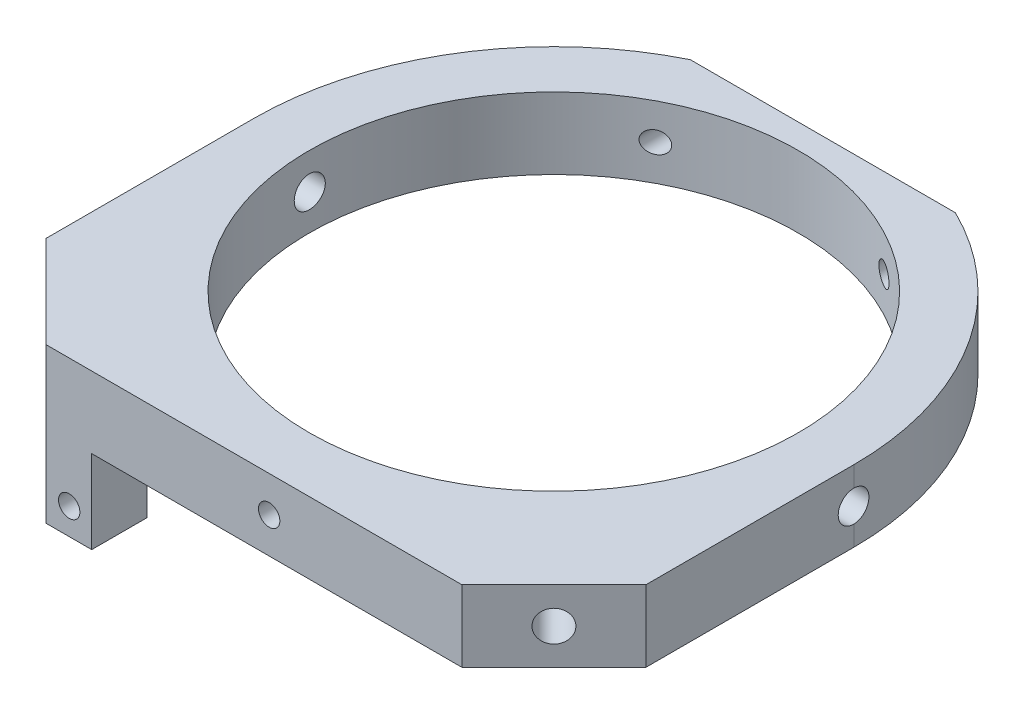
ISO-10303-21;
HEADER;
FILE_DESCRIPTION(('STEP AP214'),'2;1');
FILE_NAME('part.step','',(''),(''),'','','');
FILE_SCHEMA(('AUTOMOTIVE_DESIGN { 1 0 10303 214 1 1 1 1 }'));
ENDSEC;
DATA;
#1=APPLICATION_CONTEXT('core data for automotive mechanical design processes');
#2=APPLICATION_PROTOCOL_DEFINITION('international standard','automotive_design',2000,#1);
#3=PRODUCT_CONTEXT('',#1,'mechanical');
#4=PRODUCT('Part','Part','',(#3));
#5=PRODUCT_RELATED_PRODUCT_CATEGORY('part','',(#4));
#6=PRODUCT_DEFINITION_FORMATION('','',#4);
#7=PRODUCT_DEFINITION_CONTEXT('part definition',#1,'design');
#8=PRODUCT_DEFINITION('design','',#6,#7);
#9=PRODUCT_DEFINITION_SHAPE('','',#8);
#10=(LENGTH_UNIT() NAMED_UNIT(*) SI_UNIT(.MILLI.,.METRE.));
#11=(NAMED_UNIT(*) PLANE_ANGLE_UNIT() SI_UNIT($,.RADIAN.));
#12=(NAMED_UNIT(*) SI_UNIT($,.STERADIAN.) SOLID_ANGLE_UNIT());
#13=UNCERTAINTY_MEASURE_WITH_UNIT(LENGTH_MEASURE(1.E-05),#10,'distance_accuracy_value','');
#14=(GEOMETRIC_REPRESENTATION_CONTEXT(3) GLOBAL_UNCERTAINTY_ASSIGNED_CONTEXT((#13)) GLOBAL_UNIT_ASSIGNED_CONTEXT((#10,
#11,#12)) REPRESENTATION_CONTEXT('',''));
#15=CARTESIAN_POINT('',(0.,0.,0.));
#16=DIRECTION('',(0.,0.,1.));
#17=DIRECTION('',(1.,0.,0.));
#18=AXIS2_PLACEMENT_3D('',#15,#16,#17);
#19=CARTESIAN_POINT('',(0.,0.,-33.3248));
#20=DIRECTION('',(0.,1.,0.));
#21=DIRECTION('',(0.,0.,1.));
#22=AXIS2_PLACEMENT_3D('',#19,#20,#21);
#23=PLANE('',#22);
#24=CARTESIAN_POINT('',(0.,0.,-33.3248));
#25=DIRECTION('',(0.,1.,0.));
#26=DIRECTION('',(0.,0.,1.));
#27=AXIS2_PLACEMENT_3D('',#24,#25,#26);
#28=CIRCLE('',#27,27.178);
#29=CARTESIAN_POINT('',(0.,0.,-6.1468));
#30=VERTEX_POINT('',#29);
#31=EDGE_CURVE('E351',#30,#30,#28,.T.);
#32=ORIENTED_EDGE('',*,*,#31,.T.);
#33=EDGE_LOOP('',(#32));
#34=FACE_BOUND('',#33,.T.);
#35=DIRECTION('',(0.,0.,-1.));
#36=VECTOR('',#35,1.);
#37=CARTESIAN_POINT('',(-23.114,0.,0.));
#38=LINE('',#37,#36);
#39=CARTESIAN_POINT('',(-23.114,0.,0.));
#40=VERTEX_POINT('',#39);
#41=CARTESIAN_POINT('',(-23.114,0.,-6.1468));
#42=VERTEX_POINT('',#41);
#43=EDGE_CURVE('E139',#40,#42,#38,.T.);
#44=ORIENTED_EDGE('',*,*,#43,.F.);
#45=DIRECTION('',(0.707106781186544,0.,0.707106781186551));
#46=VECTOR('',#45,1.);
#47=CARTESIAN_POINT('',(-23.114,0.,0.));
#48=LINE('',#47,#46);
#49=CARTESIAN_POINT('',(-33.3375,0.,-10.2235000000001));
#50=VERTEX_POINT('',#49);
#51=EDGE_CURVE('E215',#50,#40,#48,.T.);
#52=ORIENTED_EDGE('',*,*,#51,.F.);
#53=DIRECTION('',(0.,0.,1.));
#54=VECTOR('',#53,1.);
#55=CARTESIAN_POINT('',(-33.3375,0.,-10.2235000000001));
#56=LINE('',#55,#54);
#57=CARTESIAN_POINT('',(-33.3375,0.,-33.3248));
#58=VERTEX_POINT('',#57);
#59=EDGE_CURVE('E236',#58,#50,#56,.T.);
#60=ORIENTED_EDGE('',*,*,#59,.F.);
#61=CARTESIAN_POINT('',(0.,0.,-33.3248));
#62=DIRECTION('',(0.,1.,0.));
#63=DIRECTION('',(0.,0.,1.));
#64=AXIS2_PLACEMENT_3D('',#61,#62,#63);
#65=CIRCLE('',#64,33.3375);
#66=CARTESIAN_POINT('',(-14.732,0.,-63.2306034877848));
#67=VERTEX_POINT('',#66);
#68=EDGE_CURVE('E233',#67,#58,#65,.T.);
#69=ORIENTED_EDGE('',*,*,#68,.F.);
#70=DIRECTION('',(-1.,0.,0.));
#71=VECTOR('',#70,1.);
#72=CARTESIAN_POINT('',(-14.732,0.,-63.2306034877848));
#73=LINE('',#72,#71);
#74=CARTESIAN_POINT('',(14.732,0.,-63.2306034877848));
#75=VERTEX_POINT('',#74);
#76=EDGE_CURVE('E231',#75,#67,#73,.T.);
#77=ORIENTED_EDGE('',*,*,#76,.F.);
#78=CARTESIAN_POINT('',(0.,0.,-33.3248));
#79=DIRECTION('',(0.,1.,0.));
#80=DIRECTION('',(0.,0.,1.));
#81=AXIS2_PLACEMENT_3D('',#78,#79,#80);
#82=CIRCLE('',#81,33.3375);
#83=CARTESIAN_POINT('',(33.3375,0.,-33.3248));
#84=VERTEX_POINT('',#83);
#85=EDGE_CURVE('E229',#84,#75,#82,.T.);
#86=ORIENTED_EDGE('',*,*,#85,.F.);
#87=DIRECTION('',(0.,0.,-1.));
#88=VECTOR('',#87,1.);
#89=CARTESIAN_POINT('',(33.3375,0.,-10.2235000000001));
#90=LINE('',#89,#88);
#91=CARTESIAN_POINT('',(33.3375,0.,-10.2235000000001));
#92=VERTEX_POINT('',#91);
#93=EDGE_CURVE('E226',#92,#84,#90,.T.);
#94=ORIENTED_EDGE('',*,*,#93,.F.);
#95=DIRECTION('',(0.707106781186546,0.,-0.707106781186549));
#96=VECTOR('',#95,1.);
#97=CARTESIAN_POINT('',(23.114,0.,0.));
#98=LINE('',#97,#96);
#99=CARTESIAN_POINT('',(23.114,0.,0.));
#100=VERTEX_POINT('',#99);
#101=EDGE_CURVE('E214',#100,#92,#98,.T.);
#102=ORIENTED_EDGE('',*,*,#101,.F.);
#103=DIRECTION('',(1.,0.,0.));
#104=VECTOR('',#103,1.);
#105=CARTESIAN_POINT('',(-23.114,0.,0.));
#106=LINE('',#105,#104);
#107=CARTESIAN_POINT('',(-18.034,0.,0.));
#108=VERTEX_POINT('',#107);
#109=EDGE_CURVE('E51',#108,#100,#106,.T.);
#110=ORIENTED_EDGE('',*,*,#109,.F.);
#111=DIRECTION('',(0.,0.,1.));
#112=VECTOR('',#111,1.);
#113=CARTESIAN_POINT('',(-18.034,0.,0.));
#114=LINE('',#113,#112);
#115=CARTESIAN_POINT('',(-18.034,0.,-6.1468));
#116=VERTEX_POINT('',#115);
#117=EDGE_CURVE('E124',#116,#108,#114,.T.);
#118=ORIENTED_EDGE('',*,*,#117,.F.);
#119=DIRECTION('',(1.,0.,0.));
#120=VECTOR('',#119,1.);
#121=CARTESIAN_POINT('',(-23.114,0.,-6.1468));
#122=LINE('',#121,#120);
#123=EDGE_CURVE('E45',#42,#116,#122,.T.);
#124=ORIENTED_EDGE('',*,*,#123,.F.);
#125=EDGE_LOOP('',(#44,#52,#60,#69,#77,#86,#94,#102,#110,#118,#124));
#126=FACE_BOUND('',#125,.T.);
#127=ADVANCED_FACE('F28',(#34,#126),#23,.F.);
#128=CARTESIAN_POINT('',(0.,7.9502,-33.3248));
#129=DIRECTION('',(0.,1.,0.));
#130=DIRECTION('',(0.,0.,1.));
#131=AXIS2_PLACEMENT_3D('',#128,#129,#130);
#132=PLANE('',#131);
#133=DIRECTION('',(0.707106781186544,0.,0.707106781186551));
#134=VECTOR('',#133,1.);
#135=CARTESIAN_POINT('',(-23.114,7.9502,0.));
#136=LINE('',#135,#134);
#137=CARTESIAN_POINT('',(-33.3375,7.9502,-10.2235000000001));
#138=VERTEX_POINT('',#137);
#139=CARTESIAN_POINT('',(-23.114,7.9502,0.));
#140=VERTEX_POINT('',#139);
#141=EDGE_CURVE('E238',#138,#140,#136,.T.);
#142=ORIENTED_EDGE('',*,*,#141,.T.);
#143=DIRECTION('',(1.,0.,0.));
#144=VECTOR('',#143,1.);
#145=CARTESIAN_POINT('',(-23.114,7.9502,0.));
#146=LINE('',#145,#144);
#147=CARTESIAN_POINT('',(23.114,7.9502,0.));
#148=VERTEX_POINT('',#147);
#149=EDGE_CURVE('E241',#140,#148,#146,.T.);
#150=ORIENTED_EDGE('',*,*,#149,.T.);
#151=DIRECTION('',(0.707106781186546,0.,-0.707106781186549));
#152=VECTOR('',#151,1.);
#153=CARTESIAN_POINT('',(23.114,7.9502,0.));
#154=LINE('',#153,#152);
#155=CARTESIAN_POINT('',(33.3375,7.9502,-10.2235000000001));
#156=VERTEX_POINT('',#155);
#157=EDGE_CURVE('E243',#148,#156,#154,.T.);
#158=ORIENTED_EDGE('',*,*,#157,.T.);
#159=DIRECTION('',(0.,0.,-1.));
#160=VECTOR('',#159,1.);
#161=CARTESIAN_POINT('',(33.3375,7.9502,-10.2235000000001));
#162=LINE('',#161,#160);
#163=CARTESIAN_POINT('',(33.3375,7.9502,-33.3248));
#164=VERTEX_POINT('',#163);
#165=EDGE_CURVE('E245',#156,#164,#162,.T.);
#166=ORIENTED_EDGE('',*,*,#165,.T.);
#167=CARTESIAN_POINT('',(0.,7.9502,-33.3248));
#168=DIRECTION('',(0.,1.,0.));
#169=DIRECTION('',(0.,0.,1.));
#170=AXIS2_PLACEMENT_3D('',#167,#168,#169);
#171=CIRCLE('',#170,33.3375);
#172=CARTESIAN_POINT('',(14.732,7.9502,-63.2306034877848));
#173=VERTEX_POINT('',#172);
#174=EDGE_CURVE('E247',#164,#173,#171,.T.);
#175=ORIENTED_EDGE('',*,*,#174,.T.);
#176=DIRECTION('',(-1.,0.,0.));
#177=VECTOR('',#176,1.);
#178=CARTESIAN_POINT('',(-14.732,7.9502,-63.2306034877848));
#179=LINE('',#178,#177);
#180=CARTESIAN_POINT('',(-14.732,7.9502,-63.2306034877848));
#181=VERTEX_POINT('',#180);
#182=EDGE_CURVE('E249',#173,#181,#179,.T.);
#183=ORIENTED_EDGE('',*,*,#182,.T.);
#184=CARTESIAN_POINT('',(0.,7.9502,-33.3248));
#185=DIRECTION('',(0.,1.,0.));
#186=DIRECTION('',(0.,0.,1.));
#187=AXIS2_PLACEMENT_3D('',#184,#185,#186);
#188=CIRCLE('',#187,33.3375);
#189=CARTESIAN_POINT('',(-33.3375,7.9502,-33.3248));
#190=VERTEX_POINT('',#189);
#191=EDGE_CURVE('E251',#181,#190,#188,.T.);
#192=ORIENTED_EDGE('',*,*,#191,.T.);
#193=DIRECTION('',(0.,0.,1.));
#194=VECTOR('',#193,1.);
#195=CARTESIAN_POINT('',(-33.3375,7.9502,-10.2235000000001));
#196=LINE('',#195,#194);
#197=EDGE_CURVE('E253',#190,#138,#196,.T.);
#198=ORIENTED_EDGE('',*,*,#197,.T.);
#199=EDGE_LOOP('',(#142,#150,#158,#166,#175,#183,#192,#198));
#200=FACE_BOUND('',#199,.T.);
#201=CARTESIAN_POINT('',(0.,7.9502,-33.3248));
#202=DIRECTION('',(0.,1.,0.));
#203=DIRECTION('',(0.,0.,1.));
#204=AXIS2_PLACEMENT_3D('',#201,#202,#203);
#205=CIRCLE('',#204,27.178);
#206=CARTESIAN_POINT('',(0.,7.9502,-6.1468));
#207=VERTEX_POINT('',#206);
#208=EDGE_CURVE('E353',#207,#207,#205,.T.);
#209=ORIENTED_EDGE('',*,*,#208,.F.);
#210=EDGE_LOOP('',(#209));
#211=FACE_BOUND('',#210,.T.);
#212=ADVANCED_FACE('F339',(#200,#211),#132,.T.);
#213=CARTESIAN_POINT('',(-23.114,7.9502,0.));
#214=DIRECTION('',(0.707106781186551,0.,-0.707106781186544));
#215=DIRECTION('',(-0.707106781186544,0.,-0.707106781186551));
#216=AXIS2_PLACEMENT_3D('',#213,#214,#215);
#217=PLANE('',#216);
#218=CARTESIAN_POINT('',(-28.22575,3.9624,-5.11175000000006));
#219=DIRECTION('',(-0.707106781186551,0.,0.707106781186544));
#220=DIRECTION('',(0.707106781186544,0.,0.707106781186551));
#221=AXIS2_PLACEMENT_3D('',#218,#219,#220);
#222=CIRCLE('',#221,1.7272);
#223=CARTESIAN_POINT('',(-27.0044351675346,3.9624,-3.89043516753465));
#224=VERTEX_POINT('',#223);
#225=EDGE_CURVE('E152',#224,#224,#222,.T.);
#226=ORIENTED_EDGE('',*,*,#225,.F.);
#227=EDGE_LOOP('',(#226));
#228=FACE_BOUND('',#227,.T.);
#229=ORIENTED_EDGE('',*,*,#51,.T.);
#230=DIRECTION('',(0.,-1.,0.));
#231=VECTOR('',#230,1.);
#232=CARTESIAN_POINT('',(-23.114,7.9502,0.));
#233=LINE('',#232,#231);
#234=EDGE_CURVE('E11',#140,#40,#233,.T.);
#235=ORIENTED_EDGE('',*,*,#234,.F.);
#236=ORIENTED_EDGE('',*,*,#141,.F.);
#237=DIRECTION('',(0.,-1.,0.));
#238=VECTOR('',#237,1.);
#239=CARTESIAN_POINT('',(-33.3375,7.9502,-10.2235000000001));
#240=LINE('',#239,#238);
#241=EDGE_CURVE('E255',#138,#50,#240,.T.);
#242=ORIENTED_EDGE('',*,*,#241,.T.);
#243=EDGE_LOOP('',(#229,#235,#236,#242));
#244=FACE_BOUND('',#243,.T.);
#245=ADVANCED_FACE('F30',(#228,#244),#217,.F.);
#246=CARTESIAN_POINT('',(-23.114,7.9502,0.));
#247=DIRECTION('',(0.,0.,-1.));
#248=DIRECTION('',(-1.,0.,0.));
#249=AXIS2_PLACEMENT_3D('',#246,#247,#248);
#250=PLANE('',#249);
#251=CARTESIAN_POINT('',(1.68909999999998,3.9624,0.));
#252=DIRECTION('',(0.,0.,1.));
#253=DIRECTION('',(1.,0.,0.));
#254=AXIS2_PLACEMENT_3D('',#251,#252,#253);
#255=CIRCLE('',#254,1.18745);
#256=CARTESIAN_POINT('',(2.87654999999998,3.9624,0.));
#257=VERTEX_POINT('',#256);
#258=EDGE_CURVE('E200',#257,#257,#255,.T.);
#259=ORIENTED_EDGE('',*,*,#258,.F.);
#260=EDGE_LOOP('',(#259));
#261=FACE_BOUND('',#260,.T.);
#262=CARTESIAN_POINT('',(-20.5359,-6.2992,0.));
#263=DIRECTION('',(0.,0.,1.));
#264=DIRECTION('',(1.,0.,0.));
#265=AXIS2_PLACEMENT_3D('',#262,#263,#264);
#266=CIRCLE('',#265,1.18745);
#267=CARTESIAN_POINT('',(-19.34845,-6.2992,0.));
#268=VERTEX_POINT('',#267);
#269=EDGE_CURVE('E203',#268,#268,#266,.T.);
#270=ORIENTED_EDGE('',*,*,#269,.F.);
#271=EDGE_LOOP('',(#270));
#272=FACE_BOUND('',#271,.T.);
#273=ORIENTED_EDGE('',*,*,#234,.T.);
#274=DIRECTION('',(0.,1.,0.));
#275=VECTOR('',#274,1.);
#276=CARTESIAN_POINT('',(-23.114,-9.2456,0.));
#277=LINE('',#276,#275);
#278=CARTESIAN_POINT('',(-23.114,-9.2456,0.));
#279=VERTEX_POINT('',#278);
#280=EDGE_CURVE('E147',#279,#40,#277,.T.);
#281=ORIENTED_EDGE('',*,*,#280,.F.);
#282=DIRECTION('',(-1.,0.,0.));
#283=VECTOR('',#282,1.);
#284=CARTESIAN_POINT('',(-23.114,-9.2456,0.));
#285=LINE('',#284,#283);
#286=CARTESIAN_POINT('',(-18.034,-9.2456,0.));
#287=VERTEX_POINT('',#286);
#288=EDGE_CURVE('E411',#287,#279,#285,.T.);
#289=ORIENTED_EDGE('',*,*,#288,.F.);
#290=DIRECTION('',(0.,1.,0.));
#291=VECTOR('',#290,1.);
#292=CARTESIAN_POINT('',(-18.034,-9.2456,0.));
#293=LINE('',#292,#291);
#294=EDGE_CURVE('E143',#287,#108,#293,.T.);
#295=ORIENTED_EDGE('',*,*,#294,.T.);
#296=ORIENTED_EDGE('',*,*,#109,.T.);
#297=DIRECTION('',(0.,-1.,0.));
#298=VECTOR('',#297,1.);
#299=CARTESIAN_POINT('',(23.114,7.9502,0.));
#300=LINE('',#299,#298);
#301=EDGE_CURVE('E37',#148,#100,#300,.T.);
#302=ORIENTED_EDGE('',*,*,#301,.F.);
#303=ORIENTED_EDGE('',*,*,#149,.F.);
#304=EDGE_LOOP('',(#273,#281,#289,#295,#296,#302,#303));
#305=FACE_BOUND('',#304,.T.);
#306=ADVANCED_FACE('F332',(#261,#272,#305),#250,.F.);
#307=CARTESIAN_POINT('',(23.114,7.9502,0.));
#308=DIRECTION('',(-0.707106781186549,0.,-0.707106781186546));
#309=DIRECTION('',(-0.707106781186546,0.,0.707106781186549));
#310=AXIS2_PLACEMENT_3D('',#307,#308,#309);
#311=PLANE('',#310);
#312=CARTESIAN_POINT('',(28.22575,3.9624,-5.11175000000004));
#313=DIRECTION('',(0.707106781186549,0.,0.707106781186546));
#314=DIRECTION('',(0.707106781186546,0.,-0.707106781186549));
#315=AXIS2_PLACEMENT_3D('',#312,#313,#314);
#316=CIRCLE('',#315,1.7272);
#317=CARTESIAN_POINT('',(29.4470648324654,3.9624,-6.33306483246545));
#318=VERTEX_POINT('',#317);
#319=EDGE_CURVE('E354',#318,#318,#316,.T.);
#320=ORIENTED_EDGE('',*,*,#319,.F.);
#321=EDGE_LOOP('',(#320));
#322=FACE_BOUND('',#321,.T.);
#323=ORIENTED_EDGE('',*,*,#101,.T.);
#324=DIRECTION('',(0.,-1.,0.));
#325=VECTOR('',#324,1.);
#326=CARTESIAN_POINT('',(33.3375,7.9502,-10.2235000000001));
#327=LINE('',#326,#325);
#328=EDGE_CURVE('E272',#156,#92,#327,.T.);
#329=ORIENTED_EDGE('',*,*,#328,.F.);
#330=ORIENTED_EDGE('',*,*,#157,.F.);
#331=ORIENTED_EDGE('',*,*,#301,.T.);
#332=EDGE_LOOP('',(#323,#329,#330,#331));
#333=FACE_BOUND('',#332,.T.);
#334=ADVANCED_FACE('F329',(#322,#333),#311,.F.);
#335=CARTESIAN_POINT('',(33.3375,7.9502,-10.2235000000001));
#336=DIRECTION('',(-1.,0.,0.));
#337=DIRECTION('',(0.,0.,1.));
#338=AXIS2_PLACEMENT_3D('',#335,#336,#337);
#339=PLANE('',#338);
#340=DIRECTION('',(0.,-1.,0.));
#341=VECTOR('',#340,1.);
#342=CARTESIAN_POINT('',(33.3375,7.9502,-33.3248));
#343=LINE('',#342,#341);
#344=CARTESIAN_POINT('',(33.3375,2.2352,-33.3248));
#345=VERTEX_POINT('',#344);
#346=EDGE_CURVE('E268',#345,#84,#343,.T.);
#347=ORIENTED_EDGE('',*,*,#346,.F.);
#348=CARTESIAN_POINT('',(33.3375,3.9624,-33.3248));
#349=DIRECTION('',(1.,0.,0.));
#350=DIRECTION('',(0.,0.,-1.));
#351=AXIS2_PLACEMENT_3D('',#348,#349,#350);
#352=CIRCLE('',#351,1.7272);
#353=CARTESIAN_POINT('',(33.3375,5.6896,-33.3248));
#354=VERTEX_POINT('',#353);
#355=EDGE_CURVE('E155',#354,#345,#352,.T.);
#356=ORIENTED_EDGE('',*,*,#355,.F.);
#357=EDGE_CURVE('E269',#164,#354,#343,.T.);
#358=ORIENTED_EDGE('',*,*,#357,.F.);
#359=ORIENTED_EDGE('',*,*,#165,.F.);
#360=ORIENTED_EDGE('',*,*,#328,.T.);
#361=ORIENTED_EDGE('',*,*,#93,.T.);
#362=EDGE_LOOP('',(#347,#356,#358,#359,#360,#361));
#363=FACE_BOUND('',#362,.T.);
#364=ADVANCED_FACE('F325',(#363),#339,.F.);
#365=CARTESIAN_POINT('',(0.,7.9502,-33.3248));
#366=DIRECTION('',(0.,-1.,0.));
#367=DIRECTION('',(0.,0.,-1.));
#368=AXIS2_PLACEMENT_3D('',#365,#366,#367);
#369=CYLINDRICAL_SURFACE('',#368,33.3375);
#370=ORIENTED_EDGE('',*,*,#357,.T.);
#371=CARTESIAN_POINT('',(33.3375,5.6896,-33.3248));
#372=CARTESIAN_POINT('',(33.3375005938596,5.68959971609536,-33.3733584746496));
#373=CARTESIAN_POINT('',(33.3373937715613,5.68755095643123,-33.421893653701));
#374=CARTESIAN_POINT('',(33.3369715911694,5.67937787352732,-33.5186160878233));
#375=CARTESIAN_POINT('',(33.3366562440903,5.67325376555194,-33.5668033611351));
#376=CARTESIAN_POINT('',(33.3354082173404,5.6488270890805,-33.7102410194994));
#377=CARTESIAN_POINT('',(33.3341735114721,5.6244700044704,-33.8045295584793));
#378=CARTESIAN_POINT('',(33.3310355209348,5.56029160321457,-33.9876682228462));
#379=CARTESIAN_POINT('',(33.3291319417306,5.52046347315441,-34.0765159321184));
#380=CARTESIAN_POINT('',(33.3248709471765,5.42648070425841,-34.246261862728));
#381=CARTESIAN_POINT('',(33.3225136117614,5.37232858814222,-34.3271614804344));
#382=CARTESIAN_POINT('',(33.3176076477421,5.25117773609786,-34.4787927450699));
#383=CARTESIAN_POINT('',(33.3150588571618,5.18416804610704,-34.5495156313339));
#384=CARTESIAN_POINT('',(33.3100583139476,5.03921682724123,-34.6787248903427));
#385=CARTESIAN_POINT('',(33.3076065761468,4.96127363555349,-34.7372093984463));
#386=CARTESIAN_POINT('',(33.3030757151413,4.79662474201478,-34.8402959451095));
#387=CARTESIAN_POINT('',(33.3009967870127,4.70991448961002,-34.884890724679));
#388=CARTESIAN_POINT('',(33.2974482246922,4.53023045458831,-34.9588831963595));
#389=CARTESIAN_POINT('',(33.2959785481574,4.43725710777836,-34.9882819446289));
#390=CARTESIAN_POINT('',(33.2938156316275,4.24776870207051,-35.0310266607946));
#391=CARTESIAN_POINT('',(33.2931217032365,4.15125686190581,-35.0443868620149));
#392=CARTESIAN_POINT('',(33.2925864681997,3.9573556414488,-35.0547192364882));
#393=CARTESIAN_POINT('',(33.292745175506,3.85996624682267,-35.0516911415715));
#394=CARTESIAN_POINT('',(33.2938967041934,3.66717664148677,-35.0293441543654));
#395=CARTESIAN_POINT('',(33.2948887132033,3.57177458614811,-35.010041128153));
#396=CARTESIAN_POINT('',(33.2975937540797,3.38556714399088,-34.9557168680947));
#397=CARTESIAN_POINT('',(33.2993067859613,3.29476175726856,-34.9206956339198));
#398=CARTESIAN_POINT('',(33.3032617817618,3.12027197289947,-34.835910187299));
#399=CARTESIAN_POINT('',(33.3055040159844,3.03659124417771,-34.7861384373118));
#400=CARTESIAN_POINT('',(33.3102642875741,2.87877077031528,-34.673272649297));
#401=CARTESIAN_POINT('',(33.3127823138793,2.80463064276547,-34.6101791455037));
#402=CARTESIAN_POINT('',(33.3178137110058,2.66790896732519,-34.4723816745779));
#403=CARTESIAN_POINT('',(33.3203270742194,2.60533957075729,-34.3976656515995));
#404=CARTESIAN_POINT('',(33.3250641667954,2.49361046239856,-34.2387537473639));
#405=CARTESIAN_POINT('',(33.3272878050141,2.44445496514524,-34.1545548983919));
#406=CARTESIAN_POINT('',(33.3311951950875,2.36095242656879,-33.9790495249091));
#407=CARTESIAN_POINT('',(33.3328786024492,2.32661482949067,-33.8877385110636));
#408=CARTESIAN_POINT('',(33.3355111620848,2.27381333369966,-33.7007072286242));
#409=CARTESIAN_POINT('',(33.3364614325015,2.25532525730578,-33.6049939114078));
#410=CARTESIAN_POINT('',(33.337162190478,2.24173159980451,-33.4779962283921));
#411=CARTESIAN_POINT('',(33.3372888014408,2.23928097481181,-33.4473813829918));
#412=CARTESIAN_POINT('',(33.33745759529,2.23601740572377,-33.3861151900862));
#413=CARTESIAN_POINT('',(33.3374999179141,2.23520175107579,-33.3554639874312));
#414=CARTESIAN_POINT('',(33.3375,2.2352,-33.3248));
#415=B_SPLINE_CURVE_WITH_KNOTS('',3,(#371,#372,#373,#374,#375,#376,#377,#378,#379,#380,#381,
#382,#383,#384,#385,#386,#387,#388,#389,#390,#391,#392,#393,#394,#395,#396,#397,#398,#399,#400,
#401,#402,#403,#404,#405,#406,#407,#408,#409,#410,#411,#412,#413,#414),.UNSPECIFIED.,.F.,.F.,(4,
2,2,2,2,2,2,2,2,2,2,2,2,2,2,2,2,2,2,2,2,4),(0.,0.145585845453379,0.291164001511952,
0.58183957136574,0.872643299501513,1.1633958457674,1.45439720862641,1.74544287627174,
2.03664039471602,2.32781767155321,2.61873635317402,2.9096597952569,3.20029994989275,
3.4909401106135,3.7817290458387,4.07250632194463,4.36358725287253,4.65475953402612,
4.9461171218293,5.23702946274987,5.32913781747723,5.42109334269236),.UNSPECIFIED.);
#416=EDGE_CURVE('E304',#354,#345,#415,.T.);
#417=ORIENTED_EDGE('',*,*,#416,.T.);
#418=ORIENTED_EDGE('',*,*,#346,.T.);
#419=ORIENTED_EDGE('',*,*,#85,.T.);
#420=DIRECTION('',(0.,-1.,0.));
#421=VECTOR('',#420,1.);
#422=CARTESIAN_POINT('',(14.732,7.9502,-63.2306034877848));
#423=LINE('',#422,#421);
#424=EDGE_CURVE('E265',#173,#75,#423,.T.);
#425=ORIENTED_EDGE('',*,*,#424,.F.);
#426=ORIENTED_EDGE('',*,*,#174,.F.);
#427=EDGE_LOOP('',(#370,#417,#418,#419,#425,#426));
#428=FACE_BOUND('',#427,.T.);
#429=ADVANCED_FACE('F320',(#428),#369,.T.);
#430=CARTESIAN_POINT('',(-14.732,7.9502,-63.2306034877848));
#431=DIRECTION('',(0.,0.,1.));
#432=DIRECTION('',(1.,0.,0.));
#433=AXIS2_PLACEMENT_3D('',#430,#431,#432);
#434=PLANE('',#433);
#435=CARTESIAN_POINT('',(-12.7,3.9624,-63.2306034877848));
#436=DIRECTION('',(0.,0.,-1.));
#437=DIRECTION('',(1.,0.,0.));
#438=AXIS2_PLACEMENT_3D('',#435,#436,#437);
#439=CIRCLE('',#438,1.18745);
#440=CARTESIAN_POINT('',(-11.51255,3.9624,-63.2306034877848));
#441=VERTEX_POINT('',#440);
#442=EDGE_CURVE('E588',#441,#441,#439,.T.);
#443=ORIENTED_EDGE('',*,*,#442,.F.);
#444=EDGE_LOOP('',(#443));
#445=FACE_BOUND('',#444,.T.);
#446=CARTESIAN_POINT('',(12.7,3.9624,-63.2306034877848));
#447=DIRECTION('',(0.,0.,-1.));
#448=DIRECTION('',(-1.,0.,0.));
#449=AXIS2_PLACEMENT_3D('',#446,#447,#448);
#450=CIRCLE('',#449,1.18745);
#451=CARTESIAN_POINT('',(11.51255,3.9624,-63.2306034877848));
#452=VERTEX_POINT('',#451);
#453=EDGE_CURVE('E201',#452,#452,#450,.T.);
#454=ORIENTED_EDGE('',*,*,#453,.F.);
#455=EDGE_LOOP('',(#454));
#456=FACE_BOUND('',#455,.T.);
#457=ORIENTED_EDGE('',*,*,#76,.T.);
#458=DIRECTION('',(0.,-1.,0.));
#459=VECTOR('',#458,1.);
#460=CARTESIAN_POINT('',(-14.732,7.9502,-63.2306034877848));
#461=LINE('',#460,#459);
#462=EDGE_CURVE('E262',#181,#67,#461,.T.);
#463=ORIENTED_EDGE('',*,*,#462,.F.);
#464=ORIENTED_EDGE('',*,*,#182,.F.);
#465=ORIENTED_EDGE('',*,*,#424,.T.);
#466=EDGE_LOOP('',(#457,#463,#464,#465));
#467=FACE_BOUND('',#466,.T.);
#468=ADVANCED_FACE('F316',(#445,#456,#467),#434,.F.);
#469=CARTESIAN_POINT('',(0.,7.9502,-33.3248));
#470=DIRECTION('',(0.,-1.,0.));
#471=DIRECTION('',(0.,0.,-1.));
#472=AXIS2_PLACEMENT_3D('',#469,#470,#471);
#473=CYLINDRICAL_SURFACE('',#472,33.3375);
#474=DIRECTION('',(0.,-1.,0.));
#475=VECTOR('',#474,1.);
#476=CARTESIAN_POINT('',(-33.3375,7.9502,-33.3248));
#477=LINE('',#476,#475);
#478=CARTESIAN_POINT('',(-33.3375,2.2352,-33.3248));
#479=VERTEX_POINT('',#478);
#480=EDGE_CURVE('E258',#479,#58,#477,.T.);
#481=ORIENTED_EDGE('',*,*,#480,.F.);
#482=CARTESIAN_POINT('',(-33.3375,2.2352,-33.3248));
#483=CARTESIAN_POINT('',(-33.3375005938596,2.23520028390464,-33.3733584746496));
#484=CARTESIAN_POINT('',(-33.3373937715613,2.23724904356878,-33.421893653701));
#485=CARTESIAN_POINT('',(-33.3369715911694,2.24542212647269,-33.5186160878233));
#486=CARTESIAN_POINT('',(-33.3366562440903,2.25154623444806,-33.5668033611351));
#487=CARTESIAN_POINT('',(-33.3354082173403,2.2759729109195,-33.7102410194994));
#488=CARTESIAN_POINT('',(-33.3341735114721,2.3003299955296,-33.8045295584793));
#489=CARTESIAN_POINT('',(-33.3310355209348,2.36450839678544,-33.9876682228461));
#490=CARTESIAN_POINT('',(-33.3291319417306,2.4043365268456,-34.0765159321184));
#491=CARTESIAN_POINT('',(-33.3248709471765,2.4983192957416,-34.246261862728));
#492=CARTESIAN_POINT('',(-33.3225136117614,2.55247141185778,-34.3271614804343));
#493=CARTESIAN_POINT('',(-33.317607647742,2.67362226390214,-34.4787927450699));
#494=CARTESIAN_POINT('',(-33.3150588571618,2.74063195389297,-34.5495156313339));
#495=CARTESIAN_POINT('',(-33.3100583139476,2.88558317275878,-34.6787248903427));
#496=CARTESIAN_POINT('',(-33.3076065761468,2.96352636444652,-34.7372093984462));
#497=CARTESIAN_POINT('',(-33.3030757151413,3.12817525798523,-34.8402959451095));
#498=CARTESIAN_POINT('',(-33.3009967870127,3.21488551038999,-34.884890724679));
#499=CARTESIAN_POINT('',(-33.2974482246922,3.39456954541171,-34.9588831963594));
#500=CARTESIAN_POINT('',(-33.2959785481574,3.48754289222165,-34.9882819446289));
#501=CARTESIAN_POINT('',(-33.2938156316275,3.67703129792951,-35.0310266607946));
#502=CARTESIAN_POINT('',(-33.2931217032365,3.77354313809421,-35.0443868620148));
#503=CARTESIAN_POINT('',(-33.2925864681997,3.96744435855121,-35.0547192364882));
#504=CARTESIAN_POINT('',(-33.292745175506,4.06483375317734,-35.0516911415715));
#505=CARTESIAN_POINT('',(-33.2938967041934,4.25762335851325,-35.0293441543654));
#506=CARTESIAN_POINT('',(-33.2948887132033,4.35302541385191,-35.010041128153));
#507=CARTESIAN_POINT('',(-33.2975937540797,4.53923285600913,-34.9557168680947));
#508=CARTESIAN_POINT('',(-33.2993067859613,4.63003824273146,-34.9206956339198));
#509=CARTESIAN_POINT('',(-33.3032617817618,4.80452802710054,-34.835910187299));
#510=CARTESIAN_POINT('',(-33.3055040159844,4.8882087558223,-34.7861384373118));
#511=CARTESIAN_POINT('',(-33.3102642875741,5.04602922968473,-34.673272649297));
#512=CARTESIAN_POINT('',(-33.3127823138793,5.12016935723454,-34.6101791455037));
#513=CARTESIAN_POINT('',(-33.3178137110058,5.25689103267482,-34.4723816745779));
#514=CARTESIAN_POINT('',(-33.3203270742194,5.31946042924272,-34.3976656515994));
#515=CARTESIAN_POINT('',(-33.3250641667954,5.43118953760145,-34.2387537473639));
#516=CARTESIAN_POINT('',(-33.3272878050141,5.48034503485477,-34.1545548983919));
#517=CARTESIAN_POINT('',(-33.3311951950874,5.56384757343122,-33.979049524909));
#518=CARTESIAN_POINT('',(-33.3328786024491,5.59818517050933,-33.8877385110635));
#519=CARTESIAN_POINT('',(-33.3355111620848,5.65098666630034,-33.7007072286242));
#520=CARTESIAN_POINT('',(-33.3364614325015,5.66947474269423,-33.6049939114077));
#521=CARTESIAN_POINT('',(-33.337162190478,5.6830684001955,-33.4779962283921));
#522=CARTESIAN_POINT('',(-33.3372888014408,5.68551902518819,-33.4473813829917));
#523=CARTESIAN_POINT('',(-33.33745759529,5.68878259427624,-33.3861151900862));
#524=CARTESIAN_POINT('',(-33.3374999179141,5.68959824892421,-33.3554639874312));
#525=CARTESIAN_POINT('',(-33.3375,5.6896,-33.3248));
#526=B_SPLINE_CURVE_WITH_KNOTS('',3,(#482,#483,#484,#485,#486,#487,#488,#489,#490,#491,#492,
#493,#494,#495,#496,#497,#498,#499,#500,#501,#502,#503,#504,#505,#506,#507,#508,#509,#510,#511,
#512,#513,#514,#515,#516,#517,#518,#519,#520,#521,#522,#523,#524,#525),.UNSPECIFIED.,.F.,.F.,(4,
2,2,2,2,2,2,2,2,2,2,2,2,2,2,2,2,2,2,2,2,4),(0.,0.145585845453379,0.291164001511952,
0.58183957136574,0.872643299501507,1.16339584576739,1.4543972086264,1.74544287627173,
2.03664039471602,2.32781767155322,2.61873635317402,2.9096597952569,3.20029994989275,
3.4909401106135,3.78172904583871,4.07250632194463,4.36358725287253,4.65475953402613,
4.9461171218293,5.23702946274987,5.32913781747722,5.42109334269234),.UNSPECIFIED.);
#527=CARTESIAN_POINT('',(-33.3375,5.6896,-33.3248));
#528=VERTEX_POINT('',#527);
#529=EDGE_CURVE('E298',#479,#528,#526,.T.);
#530=ORIENTED_EDGE('',*,*,#529,.T.);
#531=EDGE_CURVE('E259',#190,#528,#477,.T.);
#532=ORIENTED_EDGE('',*,*,#531,.F.);
#533=ORIENTED_EDGE('',*,*,#191,.F.);
#534=ORIENTED_EDGE('',*,*,#462,.T.);
#535=ORIENTED_EDGE('',*,*,#68,.T.);
#536=EDGE_LOOP('',(#481,#530,#532,#533,#534,#535));
#537=FACE_BOUND('',#536,.T.);
#538=ADVANCED_FACE('F310',(#537),#473,.T.);
#539=CARTESIAN_POINT('',(-33.3375,7.9502,-10.2235000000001));
#540=DIRECTION('',(1.,0.,0.));
#541=DIRECTION('',(0.,0.,-1.));
#542=AXIS2_PLACEMENT_3D('',#539,#540,#541);
#543=PLANE('',#542);
#544=ORIENTED_EDGE('',*,*,#531,.T.);
#545=CARTESIAN_POINT('',(-33.3375,3.9624,-33.3248));
#546=DIRECTION('',(1.,0.,0.));
#547=DIRECTION('',(0.,0.,-1.));
#548=AXIS2_PLACEMENT_3D('',#545,#546,#547);
#549=CIRCLE('',#548,1.7272);
#550=EDGE_CURVE('E280',#528,#479,#549,.T.);
#551=ORIENTED_EDGE('',*,*,#550,.T.);
#552=ORIENTED_EDGE('',*,*,#480,.T.);
#553=ORIENTED_EDGE('',*,*,#59,.T.);
#554=ORIENTED_EDGE('',*,*,#241,.F.);
#555=ORIENTED_EDGE('',*,*,#197,.F.);
#556=EDGE_LOOP('',(#544,#551,#552,#553,#554,#555));
#557=FACE_BOUND('',#556,.T.);
#558=ADVANCED_FACE('F315',(#557),#543,.F.);
#559=CARTESIAN_POINT('',(0.,7.9502,-33.3248));
#560=DIRECTION('',(0.,-1.,0.));
#561=DIRECTION('',(0.,0.,-1.));
#562=AXIS2_PLACEMENT_3D('',#559,#560,#561);
#563=CYLINDRICAL_SURFACE('',#562,27.178);
#564=CARTESIAN_POINT('',(-13.88745,3.9624,-56.6867865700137));
#565=CARTESIAN_POINT('',(-13.8874462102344,4.02244621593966,-56.6867890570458));
#566=CARTESIAN_POINT('',(-13.8828675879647,4.08255167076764,-56.6895124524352));
#567=CARTESIAN_POINT('',(-13.8647843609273,4.20096878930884,-56.7002474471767));
#568=CARTESIAN_POINT('',(-13.8512657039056,4.25927747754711,-56.7082673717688));
#569=CARTESIAN_POINT('',(-13.8160550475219,4.37220963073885,-56.729088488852));
#570=CARTESIAN_POINT('',(-13.7943931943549,4.42684582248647,-56.7418720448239));
#571=CARTESIAN_POINT('',(-13.7438553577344,4.5314159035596,-56.771569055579));
#572=CARTESIAN_POINT('',(-13.7149796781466,4.58134999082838,-56.7884823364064));
#573=CARTESIAN_POINT('',(-13.6492244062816,4.67838937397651,-56.8267974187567));
#574=CARTESIAN_POINT('',(-13.6119794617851,4.72516582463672,-56.8484017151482));
#575=CARTESIAN_POINT('',(-13.5318238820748,4.81186862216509,-56.8946020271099));
#576=CARTESIAN_POINT('',(-13.4889108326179,4.85179203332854,-56.9191993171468));
#577=CARTESIAN_POINT('',(-13.3925091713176,4.92924185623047,-56.9740673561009));
#578=CARTESIAN_POINT('',(-13.3383735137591,4.96573696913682,-57.0046571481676));
#579=CARTESIAN_POINT('',(-13.2257476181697,5.02908042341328,-57.0677454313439));
#580=CARTESIAN_POINT('',(-13.1672550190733,5.05592348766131,-57.1002449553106));
#581=CARTESIAN_POINT('',(-13.0400207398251,5.10237473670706,-57.1702905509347));
#582=CARTESIAN_POINT('',(-12.9708925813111,5.12072417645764,-57.207973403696));
#583=CARTESIAN_POINT('',(-12.8306093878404,5.14479071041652,-57.2836293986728));
#584=CARTESIAN_POINT('',(-12.7594535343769,5.1505026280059,-57.3216026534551));
#585=CARTESIAN_POINT('',(-12.6127034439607,5.14903775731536,-57.3990739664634));
#586=CARTESIAN_POINT('',(-12.5370932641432,5.14108677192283,-57.4385311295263));
#587=CARTESIAN_POINT('',(-12.3878326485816,5.11061129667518,-57.515549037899));
#588=CARTESIAN_POINT('',(-12.3141822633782,5.08808643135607,-57.5531097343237));
#589=CARTESIAN_POINT('',(-12.173296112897,5.02930535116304,-57.6241951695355));
#590=CARTESIAN_POINT('',(-12.1059406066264,4.9934377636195,-57.6578016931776));
#591=CARTESIAN_POINT('',(-11.9781054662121,4.90833347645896,-57.7209832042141));
#592=CARTESIAN_POINT('',(-11.9176216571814,4.85910495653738,-57.7505606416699));
#593=CARTESIAN_POINT('',(-11.8115878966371,4.75349315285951,-57.8019981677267));
#594=CARTESIAN_POINT('',(-11.7651706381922,4.69820810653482,-57.8243211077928));
#595=CARTESIAN_POINT('',(-11.6825270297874,4.57887353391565,-57.8638372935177));
#596=CARTESIAN_POINT('',(-11.6462921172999,4.51483143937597,-57.8810348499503));
#597=CARTESIAN_POINT('',(-11.5892769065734,4.38744101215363,-57.907990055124));
#598=CARTESIAN_POINT('',(-11.5672401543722,4.3247821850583,-57.9183555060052));
#599=CARTESIAN_POINT('',(-11.5338762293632,4.19607497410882,-57.9340204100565));
#600=CARTESIAN_POINT('',(-11.5225431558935,4.13002847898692,-57.9393226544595));
#601=CARTESIAN_POINT('',(-11.511596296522,4.00184394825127,-57.9444439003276));
#602=CARTESIAN_POINT('',(-11.5111575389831,3.93979021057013,-57.9446488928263));
#603=CARTESIAN_POINT('',(-11.519926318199,3.81652738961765,-57.9405470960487));
#604=CARTESIAN_POINT('',(-11.5291321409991,3.7553181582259,-57.9362411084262));
#605=CARTESIAN_POINT('',(-11.556510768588,3.63665677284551,-57.9233967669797));
#606=CARTESIAN_POINT('',(-11.5745099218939,3.57915533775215,-57.9149403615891));
#607=CARTESIAN_POINT('',(-11.6186529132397,3.46813697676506,-57.8941138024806));
#608=CARTESIAN_POINT('',(-11.6447976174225,3.41462047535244,-57.8817432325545));
#609=CARTESIAN_POINT('',(-11.7053624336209,3.31088348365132,-57.8529335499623));
#610=CARTESIAN_POINT('',(-11.7400536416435,3.26085900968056,-57.8363604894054));
#611=CARTESIAN_POINT('',(-11.8159125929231,3.16738177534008,-57.7998824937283));
#612=CARTESIAN_POINT('',(-11.857082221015,3.1239309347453,-57.7799765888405));
#613=CARTESIAN_POINT('',(-11.9481146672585,3.0411034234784,-57.7356376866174));
#614=CARTESIAN_POINT('',(-11.9984087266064,3.00232698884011,-57.7109703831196));
#615=CARTESIAN_POINT('',(-12.103509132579,2.93372145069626,-57.6589774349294));
#616=CARTESIAN_POINT('',(-12.1583172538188,2.90389588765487,-57.6316507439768));
#617=CARTESIAN_POINT('',(-12.2767102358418,2.85087723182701,-57.572086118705));
#618=CARTESIAN_POINT('',(-12.3406223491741,2.82865882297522,-57.5396309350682));
#619=CARTESIAN_POINT('',(-12.4704443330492,2.79542225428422,-57.473030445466));
#620=CARTESIAN_POINT('',(-12.5363550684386,2.78440901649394,-57.4388844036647));
#621=CARTESIAN_POINT('',(-12.6747379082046,2.77300814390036,-57.3664584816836));
#622=CARTESIAN_POINT('',(-12.74725289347,2.77369782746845,-57.3280884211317));
#623=CARTESIAN_POINT('',(-12.8909246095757,2.78817570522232,-57.2512371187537));
#624=CARTESIAN_POINT('',(-12.9620808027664,2.80196897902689,-57.2127558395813));
#625=CARTESIAN_POINT('',(-13.1043032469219,2.84333707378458,-57.135045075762));
#626=CARTESIAN_POINT('',(-13.1752239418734,2.87149912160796,-57.0958587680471));
#627=CARTESIAN_POINT('',(-13.3113901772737,2.94156704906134,-57.0198766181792));
#628=CARTESIAN_POINT('',(-13.3766354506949,2.98347357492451,-56.9830808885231));
#629=CARTESIAN_POINT('',(-13.496471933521,3.07850198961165,-56.9149142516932));
#630=CARTESIAN_POINT('',(-13.5513909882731,3.13109164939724,-56.8833824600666));
#631=CARTESIAN_POINT('',(-13.6512565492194,3.2475479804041,-56.825655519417));
#632=CARTESIAN_POINT('',(-13.6962103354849,3.31140635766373,-56.7994564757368));
#633=CARTESIAN_POINT('',(-13.7685866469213,3.43999712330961,-56.75706935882));
#634=CARTESIAN_POINT('',(-13.7975031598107,3.50360902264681,-56.7400365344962));
#635=CARTESIAN_POINT('',(-13.8438841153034,3.63612201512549,-56.7126450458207));
#636=CARTESIAN_POINT('',(-13.861383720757,3.70500613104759,-56.7022658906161));
#637=CARTESIAN_POINT('',(-13.8775252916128,3.80601230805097,-56.6926839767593));
#638=CARTESIAN_POINT('',(-13.8812397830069,3.83712582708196,-56.690477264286));
#639=CARTESIAN_POINT('',(-13.886203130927,3.89962083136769,-56.6875279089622));
#640=CARTESIAN_POINT('',(-13.8874519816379,3.93100231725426,-56.6867852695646));
#641=CARTESIAN_POINT('',(-13.88745,3.9624,-56.6867865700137));
#642=B_SPLINE_CURVE_WITH_KNOTS('',3,(#564,#565,#566,#567,#568,#569,#570,#571,#572,#573,#574,
#575,#576,#577,#578,#579,#580,#581,#582,#583,#584,#585,#586,#587,#588,#589,#590,#591,#592,#593,
#594,#595,#596,#597,#598,#599,#600,#601,#602,#603,#604,#605,#606,#607,#608,#609,#610,#611,#612,
#613,#614,#615,#616,#617,#618,#619,#620,#621,#622,#623,#624,#625,#626,#627,#628,#629,#630,#631,
#632,#633,#634,#635,#636,#637,#638,#639,#640,#641),.UNSPECIFIED.,.T.,.F.,(4,2,2,2,2,2,2,2,2,2,2,
2,2,2,2,2,2,2,2,2,2,2,2,2,2,2,2,2,2,2,2,2,2,2,2,2,2,2,4),(0.,0.180011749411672,
0.360307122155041,0.539941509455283,0.719568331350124,0.909546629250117,1.09960610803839,
1.31503524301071,1.53058198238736,1.77205763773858,2.01363218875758,2.26935061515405,
2.5250756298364,2.77387109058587,3.02251457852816,3.24792663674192,3.47314857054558,
3.67374942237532,3.87423962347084,4.05949726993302,4.24472199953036,4.42642834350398,
4.60815401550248,4.79662355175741,4.98514802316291,5.18868968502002,5.3923117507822,
5.61650855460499,5.8408037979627,6.08585021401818,6.33099166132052,6.58706655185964,
6.84315348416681,7.08870670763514,7.33407994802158,7.54858612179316,7.7624284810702,
7.85655495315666,7.95068164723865),.UNSPECIFIED.);
#643=CARTESIAN_POINT('',(-13.88745,3.9624,-56.6867865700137));
#644=VERTEX_POINT('',#643);
#645=EDGE_CURVE('E582',#644,#644,#642,.T.);
#646=ORIENTED_EDGE('',*,*,#645,.T.);
#647=EDGE_LOOP('',(#646));
#648=FACE_BOUND('',#647,.T.);
#649=CARTESIAN_POINT('',(11.51255,3.9624,-57.9439973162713));
#650=CARTESIAN_POINT('',(11.5125535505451,4.02434640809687,-57.9439958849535));
#651=CARTESIAN_POINT('',(11.5174224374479,4.08635053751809,-57.9417206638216));
#652=CARTESIAN_POINT('',(11.5366972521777,4.20857863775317,-57.9326932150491));
#653=CARTESIAN_POINT('',(11.5511173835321,4.26879981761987,-57.9259343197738));
#654=CARTESIAN_POINT('',(11.5888224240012,4.38557400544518,-57.9081949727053));
#655=CARTESIAN_POINT('',(11.6120863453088,4.44213532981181,-57.8972245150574));
#656=CARTESIAN_POINT('',(11.6665288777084,4.5503147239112,-57.8714228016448));
#657=CARTESIAN_POINT('',(11.6977062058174,4.60193359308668,-57.8565921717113));
#658=CARTESIAN_POINT('',(11.7680678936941,4.70088114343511,-57.8229189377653));
#659=CARTESIAN_POINT('',(11.8074963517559,4.74799364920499,-57.8039530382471));
#660=CARTESIAN_POINT('',(11.8922814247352,4.83493614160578,-57.7628757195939));
#661=CARTESIAN_POINT('',(11.9376400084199,4.87476369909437,-57.7407632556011));
#662=CARTESIAN_POINT('',(12.0372070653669,4.94980398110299,-57.6918405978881));
#663=CARTESIAN_POINT('',(12.0918439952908,4.98428896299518,-57.6647873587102));
#664=CARTESIAN_POINT('',(12.2049547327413,5.04362705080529,-57.6082669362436));
#665=CARTESIAN_POINT('',(12.2634301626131,5.06847605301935,-57.5787987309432));
#666=CARTESIAN_POINT('',(12.3888425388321,5.11045233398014,-57.5149983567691));
#667=CARTESIAN_POINT('',(12.456033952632,5.12653262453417,-57.480476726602));
#668=CARTESIAN_POINT('',(12.5915171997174,5.14686904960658,-57.4101319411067));
#669=CARTESIAN_POINT('',(12.6598094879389,5.15112016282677,-57.3743082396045));
#670=CARTESIAN_POINT('',(12.8015135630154,5.14779460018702,-57.2992004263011));
#671=CARTESIAN_POINT('',(12.8748815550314,5.13921047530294,-57.2598751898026));
#672=CARTESIAN_POINT('',(13.0190708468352,5.1085533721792,-57.1817530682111));
#673=CARTESIAN_POINT('',(13.0898912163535,5.08647551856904,-57.1429563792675));
#674=CARTESIAN_POINT('',(13.2285276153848,5.02845223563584,-57.0662437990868));
#675=CARTESIAN_POINT('',(13.2962413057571,4.99220827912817,-57.0283668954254));
#676=CARTESIAN_POINT('',(13.4246102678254,4.90629411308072,-56.9559014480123));
#677=CARTESIAN_POINT('',(13.4852668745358,4.85662644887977,-56.9213122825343));
#678=CARTESIAN_POINT('',(13.592997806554,4.74853291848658,-56.8594062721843));
#679=CARTESIAN_POINT('',(13.6407224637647,4.69095368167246,-56.8317513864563));
#680=CARTESIAN_POINT('',(13.7253269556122,4.56606242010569,-56.7824531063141));
#681=CARTESIAN_POINT('',(13.7622212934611,4.49876359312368,-56.7608016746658));
#682=CARTESIAN_POINT('',(13.8185025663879,4.36662681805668,-56.727654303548));
#683=CARTESIAN_POINT('',(13.8396243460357,4.30277938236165,-56.7151570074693));
#684=CARTESIAN_POINT('',(13.8708228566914,4.17155110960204,-56.696669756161));
#685=CARTESIAN_POINT('',(13.8809109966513,4.10417399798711,-56.6906730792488));
#686=CARTESIAN_POINT('',(13.8888528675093,3.97695697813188,-56.6859528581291));
#687=CARTESIAN_POINT('',(13.888078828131,3.91722821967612,-56.6864135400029));
#688=CARTESIAN_POINT('',(13.8776309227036,3.79884376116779,-56.6926214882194));
#689=CARTESIAN_POINT('',(13.867958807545,3.74018785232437,-56.698367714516));
#690=CARTESIAN_POINT('',(13.8406297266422,3.62732250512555,-56.7145604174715));
#691=CARTESIAN_POINT('',(13.8232145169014,3.57303320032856,-56.7248645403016));
#692=CARTESIAN_POINT('',(13.7812466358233,3.46830710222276,-56.7496055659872));
#693=CARTESIAN_POINT('',(13.7566925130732,3.41787109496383,-56.7640433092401));
#694=CARTESIAN_POINT('',(13.6994331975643,3.3184374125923,-56.7975583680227));
#695=CARTESIAN_POINT('',(13.6662793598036,3.26978465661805,-56.8168888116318));
#696=CARTESIAN_POINT('',(13.5940108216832,3.17871237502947,-56.8587817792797));
#697=CARTESIAN_POINT('',(13.5548934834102,3.13629562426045,-56.8813457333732));
#698=CARTESIAN_POINT('',(13.4665606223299,3.05325576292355,-56.9319668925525));
#699=CARTESIAN_POINT('',(13.4166938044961,3.01352958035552,-56.9603580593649));
#700=CARTESIAN_POINT('',(13.3122114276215,2.94298159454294,-57.0193630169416));
#701=CARTESIAN_POINT('',(13.2575934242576,2.9121644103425,-57.0499779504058));
#702=CARTESIAN_POINT('',(13.1376243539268,2.85630657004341,-57.1166430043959));
#703=CARTESIAN_POINT('',(13.0717960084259,2.83251728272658,-57.1528859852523));
#704=CARTESIAN_POINT('',(12.9373829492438,2.79684136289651,-57.2261320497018));
#705=CARTESIAN_POINT('',(12.868796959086,2.78496031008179,-57.263135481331));
#706=CARTESIAN_POINT('',(12.7250966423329,2.77286184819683,-57.339852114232));
#707=CARTESIAN_POINT('',(12.6498900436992,2.77362538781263,-57.37955179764));
#708=CARTESIAN_POINT('',(12.5002722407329,2.7894525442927,-57.4576407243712));
#709=CARTESIAN_POINT('',(12.4258611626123,2.80451839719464,-57.4960297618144));
#710=CARTESIAN_POINT('',(12.280556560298,2.84891773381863,-57.5701754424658));
#711=CARTESIAN_POINT('',(12.2096459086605,2.8781721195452,-57.605945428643));
#712=CARTESIAN_POINT('',(12.0735029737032,2.95072864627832,-57.6739272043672));
#713=CARTESIAN_POINT('',(12.0082678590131,2.99402373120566,-57.7061407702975));
#714=CARTESIAN_POINT('',(11.8912811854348,3.08989684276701,-57.7633969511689));
#715=CARTESIAN_POINT('',(11.8388659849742,3.14144177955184,-57.7888087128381));
#716=CARTESIAN_POINT('',(11.7436413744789,3.25467560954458,-57.8346627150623));
#717=CARTESIAN_POINT('',(11.7008270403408,3.31635927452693,-57.8551075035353));
#718=CARTESIAN_POINT('',(11.6311746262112,3.44070800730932,-57.8882034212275));
#719=CARTESIAN_POINT('',(11.6030972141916,3.50251875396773,-57.9014644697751));
#720=CARTESIAN_POINT('',(11.557789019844,3.63075130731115,-57.922804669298));
#721=CARTESIAN_POINT('',(11.5405332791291,3.69716210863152,-57.9308957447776));
#722=CARTESIAN_POINT('',(11.5236188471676,3.79728205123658,-57.9388188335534));
#723=CARTESIAN_POINT('',(11.5194748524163,3.83013261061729,-57.940758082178));
#724=CARTESIAN_POINT('',(11.5139395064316,3.89611660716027,-57.9433476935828));
#725=CARTESIAN_POINT('',(11.5125480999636,3.92925003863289,-57.9439980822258));
#726=CARTESIAN_POINT('',(11.51255,3.9624,-57.9439973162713));
#727=B_SPLINE_CURVE_WITH_KNOTS('',3,(#649,#650,#651,#652,#653,#654,#655,#656,#657,#658,#659,
#660,#661,#662,#663,#664,#665,#666,#667,#668,#669,#670,#671,#672,#673,#674,#675,#676,#677,#678,
#679,#680,#681,#682,#683,#684,#685,#686,#687,#688,#689,#690,#691,#692,#693,#694,#695,#696,#697,
#698,#699,#700,#701,#702,#703,#704,#705,#706,#707,#708,#709,#710,#711,#712,#713,#714,#715,#716,
#717,#718,#719,#720,#721,#722,#723,#724,#725,#726),.UNSPECIFIED.,.T.,.F.,(4,2,2,2,2,2,2,2,2,2,2,
2,2,2,2,2,2,2,2,2,2,2,2,2,2,2,2,2,2,2,2,2,2,2,2,2,2,2,4),(0.,0.185710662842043,
0.371698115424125,0.557246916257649,0.742765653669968,0.93484278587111,1.126983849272,
1.33625087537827,1.54560692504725,1.77633109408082,2.00715318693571,2.25706825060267,
2.50707366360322,2.76265923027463,3.01819636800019,3.25600587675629,3.49349545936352,
3.69750579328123,3.90130497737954,4.07961760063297,4.25789514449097,4.43095965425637,
4.60405937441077,4.78921688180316,4.97445653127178,5.18299956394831,5.39165052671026,
5.6271165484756,5.86269284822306,6.11662492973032,6.37059671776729,6.62316866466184,
6.87561387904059,7.10765578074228,7.33957839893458,7.54598961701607,7.75192301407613,
7.85130609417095,7.9506871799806),.UNSPECIFIED.);
#728=CARTESIAN_POINT('',(11.51255,3.9624,-57.9439973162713));
#729=VERTEX_POINT('',#728);
#730=EDGE_CURVE('E590',#729,#729,#727,.T.);
#731=ORIENTED_EDGE('',*,*,#730,.T.);
#732=EDGE_LOOP('',(#731));
#733=FACE_BOUND('',#732,.T.);
#734=CARTESIAN_POINT('',(2.87654999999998,3.9624,-6.29945737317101));
#735=CARTESIAN_POINT('',(2.87654702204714,4.02885340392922,-6.29945683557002));
#736=CARTESIAN_POINT('',(2.87095239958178,4.09535433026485,-6.2988597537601));
#737=CARTESIAN_POINT('',(2.8487181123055,4.22651728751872,-6.2965072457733));
#738=CARTESIAN_POINT('',(2.83206534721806,4.29117704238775,-6.29475044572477));
#739=CARTESIAN_POINT('',(2.78820690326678,4.4167334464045,-6.29019126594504));
#740=CARTESIAN_POINT('',(2.76100779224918,4.47763241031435,-6.28738953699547));
#741=CARTESIAN_POINT('',(2.69684950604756,4.59397861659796,-6.28091490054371));
#742=CARTESIAN_POINT('',(2.65989253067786,4.64942708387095,-6.27724218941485));
#743=CARTESIAN_POINT('',(2.57713946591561,4.75351149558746,-6.26923191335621));
#744=CARTESIAN_POINT('',(2.53131605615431,4.80212556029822,-6.26489230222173));
#745=CARTESIAN_POINT('',(2.43220049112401,4.89098477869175,-6.25580377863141));
#746=CARTESIAN_POINT('',(2.37890786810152,4.93122940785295,-6.25105484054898));
#747=CARTESIAN_POINT('',(2.26609317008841,5.00239244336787,-6.24137849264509));
#748=CARTESIAN_POINT('',(2.20654379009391,5.03326747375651,-6.23645036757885));
#749=CARTESIAN_POINT('',(2.08309705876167,5.08457278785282,-6.2266779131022));
#750=CARTESIAN_POINT('',(2.01919966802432,5.10500297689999,-6.22183358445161));
#751=CARTESIAN_POINT('',(1.8887638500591,5.13485655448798,-6.21243134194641));
#752=CARTESIAN_POINT('',(1.82222172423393,5.14426392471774,-6.20787385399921));
#753=CARTESIAN_POINT('',(1.6884738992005,5.15173723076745,-6.19921742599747));
#754=CARTESIAN_POINT('',(1.62126820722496,5.14980329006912,-6.19511848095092));
#755=CARTESIAN_POINT('',(1.48822962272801,5.13464693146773,-6.18749561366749));
#756=CARTESIAN_POINT('',(1.42239450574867,5.12144455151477,-6.1839706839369));
#757=CARTESIAN_POINT('',(1.29385691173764,5.08413910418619,-6.177539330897));
#758=CARTESIAN_POINT('',(1.23115439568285,5.06003617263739,-6.17463289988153));
#759=CARTESIAN_POINT('',(1.11083026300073,5.00167931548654,-6.16944395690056));
#760=CARTESIAN_POINT('',(1.05319646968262,4.96745063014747,-6.16715992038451));
#761=CARTESIAN_POINT('',(0.944484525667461,4.88978754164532,-6.16316167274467));
#762=CARTESIAN_POINT('',(0.893406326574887,4.84635320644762,-6.16144745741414));
#763=CARTESIAN_POINT('',(0.799325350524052,4.75157157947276,-6.15851610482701));
#764=CARTESIAN_POINT('',(0.756312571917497,4.70023423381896,-6.15729834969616));
#765=CARTESIAN_POINT('',(0.679509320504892,4.59106395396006,-6.15526868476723));
#766=CARTESIAN_POINT('',(0.645718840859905,4.53323102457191,-6.1544567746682));
#767=CARTESIAN_POINT('',(0.58832519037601,4.41271793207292,-6.15315327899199));
#768=CARTESIAN_POINT('',(0.564720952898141,4.35003827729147,-6.1526616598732));
#769=CARTESIAN_POINT('',(0.528365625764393,4.2216053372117,-6.15193031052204));
#770=CARTESIAN_POINT('',(0.515614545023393,4.15585204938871,-6.15169058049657));
#771=CARTESIAN_POINT('',(0.501326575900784,4.02312606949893,-6.15142317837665));
#772=CARTESIAN_POINT('',(0.499791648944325,3.95615316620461,-6.15139554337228));
#773=CARTESIAN_POINT('',(0.507984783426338,3.82290006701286,-6.15154749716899));
#774=CARTESIAN_POINT('',(0.517712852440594,3.75661987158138,-6.15172708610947));
#775=CARTESIAN_POINT('',(0.548156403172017,3.62663000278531,-6.1523242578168));
#776=CARTESIAN_POINT('',(0.568872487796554,3.56292047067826,-6.15274185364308));
#777=CARTESIAN_POINT('',(0.620703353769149,3.43988478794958,-6.15387658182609));
#778=CARTESIAN_POINT('',(0.651818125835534,3.38055863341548,-6.15459371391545));
#779=CARTESIAN_POINT('',(0.723557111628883,3.2679800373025,-6.1564096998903));
#780=CARTESIAN_POINT('',(0.76418038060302,3.21472699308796,-6.15750851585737));
#781=CARTESIAN_POINT('',(0.853780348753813,3.11579959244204,-6.16017693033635));
#782=CARTESIAN_POINT('',(0.902757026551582,3.07012521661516,-6.16174652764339));
#783=CARTESIAN_POINT('',(1.00765782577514,2.9876566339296,-6.16543589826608));
#784=CARTESIAN_POINT('',(1.06358078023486,2.95086093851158,-6.16755557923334));
#785=CARTESIAN_POINT('',(1.18078510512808,2.88717836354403,-6.17239925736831));
#786=CARTESIAN_POINT('',(1.24206646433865,2.86029146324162,-6.17512325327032));
#787=CARTESIAN_POINT('',(1.36826352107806,2.81717107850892,-6.18119066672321));
#788=CARTESIAN_POINT('',(1.43318046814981,2.80094128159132,-6.18453429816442));
#789=CARTESIAN_POINT('',(1.56478453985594,2.77959521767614,-6.19180394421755));
#790=CARTESIAN_POINT('',(1.63147168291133,2.77447906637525,-6.19572996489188));
#791=CARTESIAN_POINT('',(1.76484138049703,2.77549000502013,-6.2040793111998));
#792=CARTESIAN_POINT('',(1.83152373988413,2.7816359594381,-6.20850345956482));
#793=CARTESIAN_POINT('',(1.96289004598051,2.80502031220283,-6.21769605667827));
#794=CARTESIAN_POINT('',(2.02757395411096,2.82225892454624,-6.2224645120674));
#795=CARTESIAN_POINT('',(2.15328691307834,2.86739330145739,-6.23216211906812));
#796=CARTESIAN_POINT('',(2.21430612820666,2.89531638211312,-6.23709165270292));
#797=CARTESIAN_POINT('',(2.33078511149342,2.96102650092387,-6.24686534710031));
#798=CARTESIAN_POINT('',(2.38624502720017,2.99881327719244,-6.25170951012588));
#799=CARTESIAN_POINT('',(2.49008858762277,3.08323180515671,-6.2610628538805));
#800=CARTESIAN_POINT('',(2.53846540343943,3.12987199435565,-6.26557170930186));
#801=CARTESIAN_POINT('',(2.62670741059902,3.23067797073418,-6.27399478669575));
#802=CARTESIAN_POINT('',(2.66657061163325,3.28484551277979,-6.27790886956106));
#803=CARTESIAN_POINT('',(2.73654390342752,3.39903900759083,-6.28489893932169));
#804=CARTESIAN_POINT('',(2.76667398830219,3.45905261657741,-6.28797664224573));
#805=CARTESIAN_POINT('',(2.81638610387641,3.58328378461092,-6.29310963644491));
#806=CARTESIAN_POINT('',(2.83598102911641,3.64749609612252,-6.2951661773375));
#807=CARTESIAN_POINT('',(2.85884299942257,3.75383437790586,-6.29757718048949));
#808=CARTESIAN_POINT('',(2.86547447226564,3.79525944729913,-6.29828042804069));
#809=CARTESIAN_POINT('',(2.87432890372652,3.87858337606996,-6.29922069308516));
#810=CARTESIAN_POINT('',(2.87655187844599,3.92048223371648,-6.29945771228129));
#811=CARTESIAN_POINT('',(2.87654999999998,3.9624,-6.29945737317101));
#812=B_SPLINE_CURVE_WITH_KNOTS('',3,(#734,#735,#736,#737,#738,#739,#740,#741,#742,#743,#744,
#745,#746,#747,#748,#749,#750,#751,#752,#753,#754,#755,#756,#757,#758,#759,#760,#761,#762,#763,
#764,#765,#766,#767,#768,#769,#770,#771,#772,#773,#774,#775,#776,#777,#778,#779,#780,#781,#782,
#783,#784,#785,#786,#787,#788,#789,#790,#791,#792,#793,#794,#795,#796,#797,#798,#799,#800,#801,
#802,#803,#804,#805,#806,#807,#808,#809,#810,#811),.UNSPECIFIED.,.T.,.F.,(4,2,2,2,2,2,2,2,2,2,2,
2,2,2,2,2,2,2,2,2,2,2,2,2,2,2,2,2,2,2,2,2,2,2,2,2,2,2,4),(0.,0.199206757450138,
0.398649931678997,0.597969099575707,0.797243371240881,0.997141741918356,1.19705263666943,
1.39787536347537,1.59869991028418,1.79981593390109,2.00092976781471,2.20168671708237,
2.40244116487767,2.60269935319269,2.80295606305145,3.00296277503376,3.20296933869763,
3.4029549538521,3.60294073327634,3.80296148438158,4.00298237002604,4.20301423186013,
4.40304591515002,4.60305773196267,4.80306903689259,5.00304678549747,5.20302411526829,
5.40307060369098,5.60311917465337,5.80350314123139,6.00389097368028,6.2047945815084,
6.40569285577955,6.60678356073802,6.80792122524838,7.00864303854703,7.20911861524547,
7.33477557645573,7.46043207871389),.UNSPECIFIED.);
#813=CARTESIAN_POINT('',(2.87654999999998,3.9624,-6.29945737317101));
#814=VERTEX_POINT('',#813);
#815=EDGE_CURVE('E194',#814,#814,#812,.T.);
#816=ORIENTED_EDGE('',*,*,#815,.T.);
#817=EDGE_LOOP('',(#816));
#818=FACE_BOUND('',#817,.T.);
#819=CARTESIAN_POINT('',(-17.9643391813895,3.9624,-12.9305311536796));
#820=CARTESIAN_POINT('',(-17.9643427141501,4.05931372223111,-12.9305336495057));
#821=CARTESIAN_POINT('',(-17.9704955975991,4.15629522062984,-12.9359489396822));
#822=CARTESIAN_POINT('',(-17.9949217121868,4.3475801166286,-12.9575043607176));
#823=CARTESIAN_POINT('',(-18.0132090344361,4.44188026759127,-12.9736569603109));
#824=CARTESIAN_POINT('',(-18.0612854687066,4.62500404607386,-13.0163121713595));
#825=CARTESIAN_POINT('',(-18.0910684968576,4.71383054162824,-13.0428093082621));
#826=CARTESIAN_POINT('',(-18.1611419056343,4.88351965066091,-13.105531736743));
#827=CARTESIAN_POINT('',(-18.2014298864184,4.96438407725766,-13.1417548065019));
#828=CARTESIAN_POINT('',(-18.2912651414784,5.11600094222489,-13.223134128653));
#829=CARTESIAN_POINT('',(-18.3408248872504,5.18673953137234,-13.2683024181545));
#830=CARTESIAN_POINT('',(-18.4475831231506,5.31597812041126,-13.3664531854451));
#831=CARTESIAN_POINT('',(-18.5047819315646,5.37447761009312,-13.4194359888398));
#832=CARTESIAN_POINT('',(-18.6250718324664,5.47761925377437,-13.5319437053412));
#833=CARTESIAN_POINT('',(-18.6881676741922,5.52225011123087,-13.5914738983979));
#834=CARTESIAN_POINT('',(-18.818271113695,5.59631509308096,-13.7155056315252));
#835=CARTESIAN_POINT('',(-18.8852786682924,5.62574938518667,-13.7800071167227));
#836=CARTESIAN_POINT('',(-19.0210991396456,5.66854702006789,-13.912164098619));
#837=CARTESIAN_POINT('',(-19.0899094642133,5.68193226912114,-13.9798151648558));
#838=CARTESIAN_POINT('',(-19.2274141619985,5.69231969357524,-14.1164782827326));
#839=CARTESIAN_POINT('',(-19.2961085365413,5.6893220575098,-14.1854903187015));
#840=CARTESIAN_POINT('',(-19.4313400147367,5.66704683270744,-14.3228005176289));
#841=CARTESIAN_POINT('',(-19.4978800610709,5.64779251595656,-14.3910995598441));
#842=CARTESIAN_POINT('',(-19.6270923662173,5.59358678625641,-14.5250766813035));
#843=CARTESIAN_POINT('',(-19.6897646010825,5.55863527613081,-14.5907547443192));
#844=CARTESIAN_POINT('',(-19.8096398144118,5.47399992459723,-14.7175572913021));
#845=CARTESIAN_POINT('',(-19.8668386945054,5.42430515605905,-14.7786783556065));
#846=CARTESIAN_POINT('',(-19.9742656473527,5.31160190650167,-14.8944272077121));
#847=CARTESIAN_POINT('',(-20.0244936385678,5.2485932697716,-14.9490549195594));
#848=CARTESIAN_POINT('',(-20.1168294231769,5.11091763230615,-15.0501846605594));
#849=CARTESIAN_POINT('',(-20.1589226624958,5.03623016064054,-15.0966721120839));
#850=CARTESIAN_POINT('',(-20.2338697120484,4.87738862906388,-15.179901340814));
#851=CARTESIAN_POINT('',(-20.2667235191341,4.79323456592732,-15.2166431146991));
#852=CARTESIAN_POINT('',(-20.3224210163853,4.61783675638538,-15.2791731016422));
#853=CARTESIAN_POINT('',(-20.3452642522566,4.52659268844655,-15.3049608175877));
#854=CARTESIAN_POINT('',(-20.3804072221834,4.33961001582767,-15.3447166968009));
#855=CARTESIAN_POINT('',(-20.3927070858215,4.24387146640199,-15.3586850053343));
#856=CARTESIAN_POINT('',(-20.4064673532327,4.05079869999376,-15.3743157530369));
#857=CARTESIAN_POINT('',(-20.407946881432,3.9534676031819,-15.3759999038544));
#858=CARTESIAN_POINT('',(-20.4000830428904,3.7598133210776,-15.3670626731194));
#859=CARTESIAN_POINT('',(-20.3907397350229,3.66349013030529,-15.3564413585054));
#860=CARTESIAN_POINT('',(-20.3614576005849,3.47466740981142,-15.3232663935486));
#861=CARTESIAN_POINT('',(-20.3415276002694,3.38216476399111,-15.3007226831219));
#862=CARTESIAN_POINT('',(-20.291537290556,3.20351275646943,-15.2444624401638));
#863=CARTESIAN_POINT('',(-20.261476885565,3.11736345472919,-15.210745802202));
#864=CARTESIAN_POINT('',(-20.1918769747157,2.95373129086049,-15.1331948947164));
#865=CARTESIAN_POINT('',(-20.15232426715,2.87626072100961,-15.089346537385));
#866=CARTESIAN_POINT('',(-20.0647009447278,2.73230892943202,-14.9929782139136));
#867=CARTESIAN_POINT('',(-20.0166302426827,2.66582782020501,-14.9404581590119));
#868=CARTESIAN_POINT('',(-19.9130650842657,2.5456442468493,-14.8283315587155));
#869=CARTESIAN_POINT('',(-19.8575599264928,2.49196051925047,-14.7687148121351));
#870=CARTESIAN_POINT('',(-19.7405786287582,2.39902372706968,-14.6443150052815));
#871=CARTESIAN_POINT('',(-19.679102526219,2.35977057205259,-14.579531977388));
#872=CARTESIAN_POINT('',(-19.5518329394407,2.2968410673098,-14.4468246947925));
#873=CARTESIAN_POINT('',(-19.4860426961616,2.27315316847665,-14.3789028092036));
#874=CARTESIAN_POINT('',(-19.3518871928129,2.24198903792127,-14.2418931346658));
#875=CARTESIAN_POINT('',(-19.2835219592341,2.23451263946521,-14.1728053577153));
#876=CARTESIAN_POINT('',(-19.1462586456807,2.23598552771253,-14.035583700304));
#877=CARTESIAN_POINT('',(-19.0773617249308,2.24490572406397,-13.9674483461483));
#878=CARTESIAN_POINT('',(-18.9409057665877,2.27885844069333,-13.8339075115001));
#879=CARTESIAN_POINT('',(-18.8733467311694,2.30389098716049,-13.7685020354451));
#880=CARTESIAN_POINT('',(-18.7415750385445,2.36935069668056,-13.6421836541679));
#881=CARTESIAN_POINT('',(-18.6773622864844,2.40977742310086,-13.5812706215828));
#882=CARTESIAN_POINT('',(-18.5542353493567,2.50487399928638,-13.465515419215));
#883=CARTESIAN_POINT('',(-18.4953210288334,2.55954348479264,-13.4106730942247));
#884=CARTESIAN_POINT('',(-18.3845287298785,2.68167996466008,-13.3083444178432));
#885=CARTESIAN_POINT('',(-18.3326624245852,2.74916775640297,-13.2608702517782));
#886=CARTESIAN_POINT('',(-18.2377195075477,2.8949968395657,-13.1745295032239));
#887=CARTESIAN_POINT('',(-18.1946450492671,2.97334078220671,-13.1356650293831));
#888=CARTESIAN_POINT('',(-18.1186534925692,3.13875113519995,-13.067438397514));
#889=CARTESIAN_POINT('',(-18.0857494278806,3.22582855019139,-13.0380884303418));
#890=CARTESIAN_POINT('',(-18.0312942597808,3.40609104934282,-12.9896714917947));
#891=CARTESIAN_POINT('',(-18.0097298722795,3.49926884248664,-12.9705924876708));
#892=CARTESIAN_POINT('',(-17.9842744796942,3.65457979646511,-12.9481045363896));
#893=CARTESIAN_POINT('',(-17.9768098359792,3.71570930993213,-12.9415216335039));
#894=CARTESIAN_POINT('',(-17.9668410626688,3.83868334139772,-12.9327341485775));
#895=CARTESIAN_POINT('',(-17.9643369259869,3.90052785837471,-12.9305295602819));
#896=CARTESIAN_POINT('',(-17.9643391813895,3.9624,-12.9305311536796));
#897=B_SPLINE_CURVE_WITH_KNOTS('',3,(#819,#820,#821,#822,#823,#824,#825,#826,#827,#828,#829,
#830,#831,#832,#833,#834,#835,#836,#837,#838,#839,#840,#841,#842,#843,#844,#845,#846,#847,#848,
#849,#850,#851,#852,#853,#854,#855,#856,#857,#858,#859,#860,#861,#862,#863,#864,#865,#866,#867,
#868,#869,#870,#871,#872,#873,#874,#875,#876,#877,#878,#879,#880,#881,#882,#883,#884,#885,#886,
#887,#888,#889,#890,#891,#892,#893,#894,#895,#896),.UNSPECIFIED.,.T.,.F.,(4,2,2,2,2,2,2,2,2,2,2,
2,2,2,2,2,2,2,2,2,2,2,2,2,2,2,2,2,2,2,2,2,2,2,2,2,2,2,4),(0.,0.29051529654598,0.581368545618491,
0.872068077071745,1.16270125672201,1.45372821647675,1.7447673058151,2.0360428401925,
2.32731515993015,2.61818945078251,2.90906039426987,3.19951565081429,3.4899727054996,
3.78064557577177,4.07132184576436,4.36251345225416,4.65370515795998,4.94491007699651,
5.2361114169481,5.52679794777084,5.8174828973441,6.10792587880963,6.39837160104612,
6.68922363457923,6.98007864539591,7.27135691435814,7.56263335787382,7.85369343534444,
8.14475051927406,8.43529171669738,8.72583338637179,9.01636681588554,9.30689281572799,
9.59789427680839,9.88896693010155,10.1804110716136,10.4715130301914,10.6569855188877,
10.8424577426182),.UNSPECIFIED.);
#898=CARTESIAN_POINT('',(-17.9643391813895,3.9624,-12.9305311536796));
#899=VERTEX_POINT('',#898);
#900=EDGE_CURVE('E145',#899,#899,#897,.T.);
#901=ORIENTED_EDGE('',*,*,#900,.T.);
#902=EDGE_LOOP('',(#901));
#903=FACE_BOUND('',#902,.T.);
#904=CARTESIAN_POINT('',(-27.1230614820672,3.9624,-35.052));
#905=CARTESIAN_POINT('',(-27.1230622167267,4.0593124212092,-35.0519957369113));
#906=CARTESIAN_POINT('',(-27.1235864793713,4.15629261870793,-35.0438160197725));
#907=CARTESIAN_POINT('',(-27.1256271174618,4.34757491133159,-35.0113030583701));
#908=CARTESIAN_POINT('',(-27.1271446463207,4.44187375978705,-34.9869510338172));
#909=CARTESIAN_POINT('',(-27.1309992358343,4.62499493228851,-34.9227959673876));
#910=CARTESIAN_POINT('',(-27.133335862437,4.71382012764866,-34.8830011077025));
#911=CARTESIAN_POINT('',(-27.1385648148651,4.88350684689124,-34.7891032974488));
#912=CARTESIAN_POINT('',(-27.1414570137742,4.96437018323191,-34.7350036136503));
#913=CARTESIAN_POINT('',(-27.1474762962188,5.1159862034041,-34.613940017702));
#914=CARTESIAN_POINT('',(-27.1506036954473,5.18672491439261,-34.5469586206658));
#915=CARTESIAN_POINT('',(-27.1567380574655,5.31596407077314,-34.4020690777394));
#916=CARTESIAN_POINT('',(-27.1597450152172,5.37446400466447,-34.3241604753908));
#917=CARTESIAN_POINT('',(-27.1653024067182,5.47760789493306,-34.1595492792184));
#918=CARTESIAN_POINT('',(-27.1678524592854,5.52224030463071,-34.0728394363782));
#919=CARTESIAN_POINT('',(-27.1722053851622,5.59630826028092,-33.8931379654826));
#920=CARTESIAN_POINT('',(-27.1740082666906,5.62574397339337,-33.8001464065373));
#921=CARTESIAN_POINT('',(-27.1766615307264,5.66854423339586,-33.610655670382));
#922=CARTESIAN_POINT('',(-27.1775132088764,5.68193064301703,-33.5141614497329));
#923=CARTESIAN_POINT('',(-27.1781724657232,5.69231982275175,-33.3202921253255));
#924=CARTESIAN_POINT('',(-27.177980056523,5.6893227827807,-33.2229170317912));
#925=CARTESIAN_POINT('',(-27.1765739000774,5.66704816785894,-33.0301981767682));
#926=CARTESIAN_POINT('',(-27.1753616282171,5.64779411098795,-32.9348516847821));
#927=CARTESIAN_POINT('',(-27.1720539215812,5.59358851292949,-32.7487467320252));
#928=CARTESIAN_POINT('',(-27.1699584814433,5.55863687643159,-32.6579882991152));
#929=CARTESIAN_POINT('',(-27.1651178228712,5.47400165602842,-32.4835603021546));
#930=CARTESIAN_POINT('',(-27.1623721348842,5.4243074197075,-32.3998959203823));
#931=CARTESIAN_POINT('',(-27.1565399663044,5.31160538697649,-32.24208754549));
#932=CARTESIAN_POINT('',(-27.1534534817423,5.24859743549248,-32.1679436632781));
#933=CARTESIAN_POINT('',(-27.1472806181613,5.11092372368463,-32.0311436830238));
#934=CARTESIAN_POINT('',(-27.1441942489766,5.03623754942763,-31.9685081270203));
#935=CARTESIAN_POINT('',(-27.1383750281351,4.87739896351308,-31.8566611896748));
#936=CARTESIAN_POINT('',(-27.1356421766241,4.79324654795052,-31.8074498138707));
#937=CARTESIAN_POINT('',(-27.1308386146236,4.61785114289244,-31.723849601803));
#938=CARTESIAN_POINT('',(-27.1287679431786,4.52660773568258,-31.6894616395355));
#939=CARTESIAN_POINT('',(-27.1255236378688,4.33962644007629,-31.6364986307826));
#940=CARTESIAN_POINT('',(-27.1243499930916,4.24388860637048,-31.6179233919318));
#941=CARTESIAN_POINT('',(-27.1230341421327,4.05081531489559,-31.5971387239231));
#942=CARTESIAN_POINT('',(-27.1228901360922,3.95348294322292,-31.5949007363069));
#943=CARTESIAN_POINT('',(-27.123645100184,3.75982595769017,-31.6067794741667));
#944=CARTESIAN_POINT('',(-27.1245440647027,3.66350133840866,-31.6208961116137));
#945=CARTESIAN_POINT('',(-27.1272820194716,3.47467497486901,-31.6650596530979));
#946=CARTESIAN_POINT('',(-27.1291202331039,3.38217014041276,-31.6950933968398));
#947=CARTESIAN_POINT('',(-27.1335288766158,3.20351382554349,-31.7702252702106));
#948=CARTESIAN_POINT('',(-27.1360993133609,3.1173624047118,-31.8153235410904));
#949=CARTESIAN_POINT('',(-27.1416871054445,2.9537272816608,-31.9193772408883));
#950=CARTESIAN_POINT('',(-27.1447050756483,2.8762557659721,-31.9783518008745));
#951=CARTESIAN_POINT('',(-27.1508456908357,2.73230236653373,-32.1084561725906));
#952=CARTESIAN_POINT('',(-27.1539683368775,2.6658205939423,-32.179586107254));
#953=CARTESIAN_POINT('',(-27.1599716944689,2.54563734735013,-32.3321050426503));
#954=CARTESIAN_POINT('',(-27.1628520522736,2.49195435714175,-32.4135086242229));
#955=CARTESIAN_POINT('',(-27.1680411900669,2.3990190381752,-32.5841908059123));
#956=CARTESIAN_POINT('',(-27.1703499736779,2.35976661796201,-32.6734693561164));
#957=CARTESIAN_POINT('',(-27.1741341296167,2.29683880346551,-32.8572993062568));
#958=CARTESIAN_POINT('',(-27.1756101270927,2.2731517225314,-32.9518466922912));
#959=CARTESIAN_POINT('',(-27.1775648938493,2.24198873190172,-33.1435862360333));
#960=CARTESIAN_POINT('',(-27.1780436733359,2.23451265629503,-33.240778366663));
#961=CARTESIAN_POINT('',(-27.177950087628,2.23598551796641,-33.4348655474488));
#962=CARTESIAN_POINT('',(-27.1773795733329,2.24490553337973,-33.5317608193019));
#963=CARTESIAN_POINT('',(-27.1752552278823,2.27885739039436,-33.7226748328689));
#964=CARTESIAN_POINT('',(-27.1737013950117,2.30388926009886,-33.8166935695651));
#965=CARTESIAN_POINT('',(-27.1697850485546,2.3693477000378,-33.9991899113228));
#966=CARTESIAN_POINT('',(-27.1674225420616,2.40977413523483,-34.0876675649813));
#967=CARTESIAN_POINT('',(-27.1621540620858,2.50487016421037,-34.2565834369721));
#968=CARTESIAN_POINT('',(-27.159248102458,2.55953939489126,-34.3370218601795));
#969=CARTESIAN_POINT('',(-27.1532134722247,2.68167612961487,-34.4877226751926));
#970=CARTESIAN_POINT('',(-27.1500844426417,2.74916456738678,-34.5579680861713));
#971=CARTESIAN_POINT('',(-27.1439592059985,2.89499537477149,-34.686156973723));
#972=CARTESIAN_POINT('',(-27.1409630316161,2.97334039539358,-34.74409743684));
#973=CARTESIAN_POINT('',(-27.1354384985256,3.13875267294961,-34.8460761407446));
#974=CARTESIAN_POINT('',(-27.1329107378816,3.22583086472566,-34.8900966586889));
#975=CARTESIAN_POINT('',(-27.1286168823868,3.40609519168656,-34.9628385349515));
#976=CARTESIAN_POINT('',(-27.1268498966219,3.49927403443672,-34.9915777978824));
#977=CARTESIAN_POINT('',(-27.1247403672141,3.65458506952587,-35.0254782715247));
#978=CARTESIAN_POINT('',(-27.1241136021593,3.71571353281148,-35.0354110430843));
#979=CARTESIAN_POINT('',(-27.1232739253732,3.83868545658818,-35.0486732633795));
#980=CARTESIAN_POINT('',(-27.123061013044,3.90052891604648,-35.0520027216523));
#981=CARTESIAN_POINT('',(-27.1230614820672,3.9624,-35.052));
#982=B_SPLINE_CURVE_WITH_KNOTS('',3,(#904,#905,#906,#907,#908,#909,#910,#911,#912,#913,#914,
#915,#916,#917,#918,#919,#920,#921,#922,#923,#924,#925,#926,#927,#928,#929,#930,#931,#932,#933,
#934,#935,#936,#937,#938,#939,#940,#941,#942,#943,#944,#945,#946,#947,#948,#949,#950,#951,#952,
#953,#954,#955,#956,#957,#958,#959,#960,#961,#962,#963,#964,#965,#966,#967,#968,#969,#970,#971,
#972,#973,#974,#975,#976,#977,#978,#979,#980,#981),.UNSPECIFIED.,.T.,.F.,(4,2,2,2,2,2,2,2,2,2,2,
2,2,2,2,2,2,2,2,2,2,2,2,2,2,2,2,2,2,2,2,2,2,2,2,2,2,2,4),(0.,0.29051139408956,0.581360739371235,
0.872056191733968,1.16268531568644,1.45371174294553,1.74475033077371,2.03603060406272,
2.32730767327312,2.61818750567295,2.90906396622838,3.19952035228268,3.48997850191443,
3.78064703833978,4.07131896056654,4.36250478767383,4.65369073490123,4.94489384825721,
5.23609341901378,5.52678383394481,5.8174726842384,6.10792156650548,6.39837317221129,
6.68922759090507,6.9800849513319,7.27135985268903,7.56263290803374,7.85368702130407,
8.14473815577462,8.43527638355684,8.72581511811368,9.01635130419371,9.30688008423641,
9.59788744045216,9.88896598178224,10.1804136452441,10.4715190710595,10.6569883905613,
10.8424574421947),.UNSPECIFIED.);
#983=CARTESIAN_POINT('',(-27.1230614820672,3.9624,-35.052));
#984=VERTEX_POINT('',#983);
#985=EDGE_CURVE('E216',#984,#984,#982,.T.);
#986=ORIENTED_EDGE('',*,*,#985,.F.);
#987=EDGE_LOOP('',(#986));
#988=FACE_BOUND('',#987,.T.);
#989=CARTESIAN_POINT('',(27.1230614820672,3.9624,-35.052));
#990=CARTESIAN_POINT('',(27.1230622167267,3.8654875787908,-35.0519957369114));
#991=CARTESIAN_POINT('',(27.1235864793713,3.76850738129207,-35.0438160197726));
#992=CARTESIAN_POINT('',(27.1256271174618,3.57722508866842,-35.0113030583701));
#993=CARTESIAN_POINT('',(27.1271446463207,3.48292624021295,-34.9869510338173));
#994=CARTESIAN_POINT('',(27.1309992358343,3.2998050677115,-34.9227959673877));
#995=CARTESIAN_POINT('',(27.133335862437,3.21097987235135,-34.8830011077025));
#996=CARTESIAN_POINT('',(27.1385648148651,3.04129315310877,-34.7891032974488));
#997=CARTESIAN_POINT('',(27.1414570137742,2.9604298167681,-34.7350036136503));
#998=CARTESIAN_POINT('',(27.1474762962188,2.8088137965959,-34.613940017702));
#999=CARTESIAN_POINT('',(27.1506036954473,2.73807508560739,-34.5469586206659));
#1000=CARTESIAN_POINT('',(27.1567380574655,2.60883592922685,-34.4020690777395));
#1001=CARTESIAN_POINT('',(27.1597450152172,2.55033599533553,-34.3241604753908));
#1002=CARTESIAN_POINT('',(27.1653024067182,2.44719210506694,-34.1595492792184));
#1003=CARTESIAN_POINT('',(27.1678524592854,2.4025596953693,-34.0728394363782));
#1004=CARTESIAN_POINT('',(27.1722053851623,2.32849173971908,-33.8931379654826));
#1005=CARTESIAN_POINT('',(27.1740082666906,2.29905602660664,-33.8001464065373));
#1006=CARTESIAN_POINT('',(27.1766615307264,2.25625576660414,-33.610655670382));
#1007=CARTESIAN_POINT('',(27.1775132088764,2.24286935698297,-33.5141614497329));
#1008=CARTESIAN_POINT('',(27.1781724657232,2.23248017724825,-33.3202921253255));
#1009=CARTESIAN_POINT('',(27.177980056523,2.2354772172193,-33.2229170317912));
#1010=CARTESIAN_POINT('',(27.1765739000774,2.25775183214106,-33.0301981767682));
#1011=CARTESIAN_POINT('',(27.1753616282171,2.27700588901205,-32.9348516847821));
#1012=CARTESIAN_POINT('',(27.1720539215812,2.33121148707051,-32.7487467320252));
#1013=CARTESIAN_POINT('',(27.1699584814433,2.36616312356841,-32.6579882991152));
#1014=CARTESIAN_POINT('',(27.1651178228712,2.45079834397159,-32.4835603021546));
#1015=CARTESIAN_POINT('',(27.1623721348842,2.5004925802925,-32.3998959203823));
#1016=CARTESIAN_POINT('',(27.1565399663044,2.61319461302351,-32.2420875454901));
#1017=CARTESIAN_POINT('',(27.1534534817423,2.67620256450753,-32.1679436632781));
#1018=CARTESIAN_POINT('',(27.1472806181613,2.81387627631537,-32.0311436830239));
#1019=CARTESIAN_POINT('',(27.1441942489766,2.88856245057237,-31.9685081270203));
#1020=CARTESIAN_POINT('',(27.1383750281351,3.04740103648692,-31.8566611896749));
#1021=CARTESIAN_POINT('',(27.1356421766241,3.13155345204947,-31.8074498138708));
#1022=CARTESIAN_POINT('',(27.1308386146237,3.30694885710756,-31.723849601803));
#1023=CARTESIAN_POINT('',(27.1287679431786,3.39819226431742,-31.6894616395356));
#1024=CARTESIAN_POINT('',(27.1255236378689,3.58517355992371,-31.6364986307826));
#1025=CARTESIAN_POINT('',(27.1243499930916,3.68091139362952,-31.6179233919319));
#1026=CARTESIAN_POINT('',(27.1230341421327,3.87398468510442,-31.5971387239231));
#1027=CARTESIAN_POINT('',(27.1228901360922,3.97131705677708,-31.5949007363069));
#1028=CARTESIAN_POINT('',(27.1236451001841,4.16497404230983,-31.6067794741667));
#1029=CARTESIAN_POINT('',(27.1245440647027,4.26129866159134,-31.6208961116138));
#1030=CARTESIAN_POINT('',(27.1272820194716,4.45012502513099,-31.665059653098));
#1031=CARTESIAN_POINT('',(27.1291202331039,4.54262985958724,-31.6950933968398));
#1032=CARTESIAN_POINT('',(27.1335288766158,4.72128617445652,-31.7702252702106));
#1033=CARTESIAN_POINT('',(27.136099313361,4.8074375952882,-31.8153235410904));
#1034=CARTESIAN_POINT('',(27.1416871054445,4.97107271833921,-31.9193772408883));
#1035=CARTESIAN_POINT('',(27.1447050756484,5.04854423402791,-31.9783518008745));
#1036=CARTESIAN_POINT('',(27.1508456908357,5.19249763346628,-32.1084561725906));
#1037=CARTESIAN_POINT('',(27.1539683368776,5.2589794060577,-32.179586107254));
#1038=CARTESIAN_POINT('',(27.1599716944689,5.37916265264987,-32.3321050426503));
#1039=CARTESIAN_POINT('',(27.1628520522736,5.43284564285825,-32.4135086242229));
#1040=CARTESIAN_POINT('',(27.1680411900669,5.5257809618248,-32.5841908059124));
#1041=CARTESIAN_POINT('',(27.170349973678,5.565033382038,-32.6734693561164));
#1042=CARTESIAN_POINT('',(27.1741341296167,5.62796119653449,-32.8572993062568));
#1043=CARTESIAN_POINT('',(27.1756101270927,5.6516482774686,-32.9518466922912));
#1044=CARTESIAN_POINT('',(27.1775648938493,5.68281126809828,-33.1435862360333));
#1045=CARTESIAN_POINT('',(27.178043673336,5.69028734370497,-33.240778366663));
#1046=CARTESIAN_POINT('',(27.177950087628,5.6888144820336,-33.4348655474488));
#1047=CARTESIAN_POINT('',(27.1773795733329,5.67989446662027,-33.5317608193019));
#1048=CARTESIAN_POINT('',(27.1752552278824,5.64594260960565,-33.7226748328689));
#1049=CARTESIAN_POINT('',(27.1737013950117,5.62091073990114,-33.8166935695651));
#1050=CARTESIAN_POINT('',(27.1697850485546,5.5554522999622,-33.9991899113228));
#1051=CARTESIAN_POINT('',(27.1674225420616,5.51502586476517,-34.0876675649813));
#1052=CARTESIAN_POINT('',(27.1621540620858,5.41992983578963,-34.2565834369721));
#1053=CARTESIAN_POINT('',(27.159248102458,5.36526060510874,-34.3370218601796));
#1054=CARTESIAN_POINT('',(27.1532134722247,5.24312387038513,-34.4877226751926));
#1055=CARTESIAN_POINT('',(27.1500844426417,5.17563543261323,-34.5579680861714));
#1056=CARTESIAN_POINT('',(27.1439592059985,5.02980462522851,-34.686156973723));
#1057=CARTESIAN_POINT('',(27.1409630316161,4.95145960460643,-34.7440974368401));
#1058=CARTESIAN_POINT('',(27.1354384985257,4.78604732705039,-34.8460761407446));
#1059=CARTESIAN_POINT('',(27.1329107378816,4.69896913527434,-34.8900966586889));
#1060=CARTESIAN_POINT('',(27.1286168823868,4.51870480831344,-34.9628385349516));
#1061=CARTESIAN_POINT('',(27.1268498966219,4.42552596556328,-34.9915777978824));
#1062=CARTESIAN_POINT('',(27.1247403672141,4.27021493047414,-35.0254782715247));
#1063=CARTESIAN_POINT('',(27.1241136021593,4.20908646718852,-35.0354110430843));
#1064=CARTESIAN_POINT('',(27.1232739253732,4.08611454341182,-35.0486732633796));
#1065=CARTESIAN_POINT('',(27.123061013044,4.02427108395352,-35.0520027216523));
#1066=CARTESIAN_POINT('',(27.1230614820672,3.9624,-35.052));
#1067=B_SPLINE_CURVE_WITH_KNOTS('',3,(#989,#990,#991,#992,#993,#994,#995,#996,#997,#998,#999,
#1000,#1001,#1002,#1003,#1004,#1005,#1006,#1007,#1008,#1009,#1010,#1011,#1012,#1013,#1014,#1015,
#1016,#1017,#1018,#1019,#1020,#1021,#1022,#1023,#1024,#1025,#1026,#1027,#1028,#1029,#1030,#1031,
#1032,#1033,#1034,#1035,#1036,#1037,#1038,#1039,#1040,#1041,#1042,#1043,#1044,#1045,#1046,#1047,
#1048,#1049,#1050,#1051,#1052,#1053,#1054,#1055,#1056,#1057,#1058,#1059,#1060,#1061,#1062,#1063,
#1064,#1065,#1066),.UNSPECIFIED.,.T.,.F.,(4,2,2,2,2,2,2,2,2,2,2,2,2,2,2,2,2,2,2,2,2,2,2,2,2,2,2,
2,2,2,2,2,2,2,2,2,2,2,4),(0.,0.290511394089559,0.581360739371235,0.872056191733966,
1.16268531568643,1.45371174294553,1.74475033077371,2.03603060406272,2.32730767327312,
2.61818750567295,2.90906396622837,3.19952035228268,3.48997850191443,3.78064703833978,
4.07131896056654,4.36250478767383,4.65369073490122,4.9448938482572,5.23609341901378,
5.5267838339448,5.8174726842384,6.10792156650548,6.3983731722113,6.68922759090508,
6.9800849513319,7.27135985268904,7.56263290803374,7.85368702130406,8.14473815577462,
8.43527638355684,8.72581511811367,9.01635130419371,9.30688008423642,9.59788744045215,
9.88896598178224,10.1804136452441,10.4715190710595,10.6569883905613,10.8424574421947),.UNSPECIFIED.);
#1068=CARTESIAN_POINT('',(27.1230614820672,3.9624,-35.052));
#1069=VERTEX_POINT('',#1068);
#1070=EDGE_CURVE('E276',#1069,#1069,#1067,.T.);
#1071=ORIENTED_EDGE('',*,*,#1070,.F.);
#1072=EDGE_LOOP('',(#1071));
#1073=FACE_BOUND('',#1072,.T.);
#1074=CARTESIAN_POINT('',(20.4061601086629,3.9624,-15.373969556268));
#1075=CARTESIAN_POINT('',(20.4061576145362,4.05931111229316,-15.3739660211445));
#1076=CARTESIAN_POINT('',(20.4007464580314,4.15629000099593,-15.3678096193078));
#1077=CARTESIAN_POINT('',(20.3792075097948,4.34756967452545,-15.3433695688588));
#1078=CARTESIAN_POINT('',(20.3630672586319,4.44186721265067,-15.3250718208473));
#1079=CARTESIAN_POINT('',(20.3204447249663,4.62498576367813,-15.2769680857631));
#1080=CARTESIAN_POINT('',(20.2939679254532,4.71380965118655,-15.2471682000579));
#1081=CARTESIAN_POINT('',(20.2312936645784,4.88349396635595,-15.1770552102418));
#1082=CARTESIAN_POINT('',(20.1950984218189,4.96435620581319,-15.1367445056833));
#1083=CARTESIAN_POINT('',(20.1137805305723,5.11597137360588,-15.0468574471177));
#1084=CARTESIAN_POINT('',(20.0686456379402,5.18671020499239,-14.9972683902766));
#1085=CARTESIAN_POINT('',(19.9705669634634,5.31594992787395,-14.8904465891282));
#1086=CARTESIAN_POINT('',(19.9176228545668,5.37445030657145,-14.8332135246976));
#1087=CARTESIAN_POINT('',(19.8051945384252,5.47759645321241,-14.7128487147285));
#1088=CARTESIAN_POINT('',(19.7457048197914,5.52223042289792,-14.6497120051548));
#1089=CARTESIAN_POINT('',(19.621756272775,5.59630136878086,-14.5195232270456));
#1090=CARTESIAN_POINT('',(19.5572974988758,5.62573851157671,-14.4524712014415));
#1091=CARTESIAN_POINT('',(19.4252263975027,5.66854141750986,-14.3165590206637));
#1092=CARTESIAN_POINT('',(19.3576184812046,5.68192899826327,-14.2477014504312));
#1093=CARTESIAN_POINT('',(19.2210412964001,5.69231995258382,-14.1101011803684));
#1094=CARTESIAN_POINT('',(19.1520720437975,5.68932351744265,-14.0413584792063));
#1095=CARTESIAN_POINT('',(19.0148480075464,5.66704952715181,-13.9060329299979));
#1096=CARTESIAN_POINT('',(18.9465923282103,5.64779573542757,-13.8394470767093));
#1097=CARTESIAN_POINT('',(18.8126994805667,5.59359027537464,-13.7101450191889));
#1098=CARTESIAN_POINT('',(18.7470623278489,5.55863851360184,-13.6474288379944));
#1099=CARTESIAN_POINT('',(18.6203406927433,5.47400342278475,-13.5274713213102));
#1100=CARTESIAN_POINT('',(18.5592594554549,5.42430971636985,-13.4702338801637));
#1101=CARTESIAN_POINT('',(18.4435856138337,5.31160889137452,-13.3627340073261));
#1102=CARTESIAN_POINT('',(18.3889930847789,5.24860161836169,-13.3124716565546));
#1103=CARTESIAN_POINT('',(18.287928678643,5.11092981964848,-13.2200727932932));
#1104=CARTESIAN_POINT('',(18.2414712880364,5.03624493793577,-13.1779507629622));
#1105=CARTESIAN_POINT('',(18.1582954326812,4.8774092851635,-13.1029519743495));
#1106=CARTESIAN_POINT('',(18.1215769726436,4.79325850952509,-13.0700752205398));
#1107=CARTESIAN_POINT('',(18.0590851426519,4.61786550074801,-13.0143374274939));
#1108=CARTESIAN_POINT('',(18.0333125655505,4.52662275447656,-12.9914771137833));
#1109=CARTESIAN_POINT('',(17.9935793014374,4.33964283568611,-12.9563072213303));
#1110=CARTESIAN_POINT('',(17.9796184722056,4.2439057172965,-12.9439975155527));
#1111=CARTESIAN_POINT('',(17.9639943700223,4.05083190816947,-12.9302247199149));
#1112=CARTESIAN_POINT('',(17.9623098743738,3.95349826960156,-12.9287429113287));
#1113=CARTESIAN_POINT('',(17.9712393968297,3.75983859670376,-12.9366104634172));
#1114=CARTESIAN_POINT('',(17.9818533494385,3.66351255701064,-12.9459597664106));
#1115=CARTESIAN_POINT('',(18.0150071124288,3.47468256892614,-12.9752622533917));
#1116=CARTESIAN_POINT('',(18.037537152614,3.38217555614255,-12.9952067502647));
#1117=CARTESIAN_POINT('',(18.0937641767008,3.20351495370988,-13.0452341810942));
#1118=CARTESIAN_POINT('',(18.127461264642,3.11736142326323,-13.0753172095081));
#1119=CARTESIAN_POINT('',(18.2049668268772,2.95372335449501,-13.1449691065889));
#1120=CARTESIAN_POINT('',(18.2487891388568,2.87625089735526,-13.1845509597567));
#1121=CARTESIAN_POINT('',(18.3451003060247,2.73229589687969,-13.272238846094));
#1122=CARTESIAN_POINT('',(18.397589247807,2.66581346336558,-13.3203449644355));
#1123=CARTESIAN_POINT('',(18.5096470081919,2.54563053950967,-13.4239841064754));
#1124=CARTESIAN_POINT('',(18.569225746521,2.49194828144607,-13.4795275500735));
#1125=CARTESIAN_POINT('',(18.6935455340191,2.39901442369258,-13.5965887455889));
#1126=CARTESIAN_POINT('',(18.7582865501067,2.35976273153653,-13.6581064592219));
#1127=CARTESIAN_POINT('',(18.8909056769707,2.29683658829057,-13.7854600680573));
#1128=CARTESIAN_POINT('',(18.9587813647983,2.27315031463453,-13.8512926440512));
#1129=CARTESIAN_POINT('',(19.0956968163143,2.24198844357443,-13.9855333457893));
#1130=CARTESIAN_POINT('',(19.1647365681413,2.23451268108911,-14.0539414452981));
#1131=CARTESIAN_POINT('',(19.3018632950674,2.23598549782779,-14.19129121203));
#1132=CARTESIAN_POINT('',(19.3699517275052,2.24490532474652,-14.2602317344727));
#1133=CARTESIAN_POINT('',(19.5033998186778,2.27885631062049,-14.3967732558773));
#1134=CARTESIAN_POINT('',(19.5687594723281,2.30388749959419,-14.4643742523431));
#1135=CARTESIAN_POINT('',(19.6949913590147,2.36934466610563,-14.5962299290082));
#1136=CARTESIAN_POINT('',(19.7558635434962,2.40977081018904,-14.6604845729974));
#1137=CARTESIAN_POINT('',(19.8715407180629,2.50486629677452,-14.7836915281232));
#1138=CARTESIAN_POINT('',(19.9263458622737,2.55953527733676,-14.8426439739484));
#1139=CARTESIAN_POINT('',(20.0286060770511,2.68167227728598,-14.9535090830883));
#1140=CARTESIAN_POINT('',(20.0760488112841,2.74916136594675,-15.0054099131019));
#1141=CARTESIAN_POINT('',(20.1623321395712,2.89499391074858,-15.1004158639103));
#1142=CARTESIAN_POINT('',(20.2011706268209,2.97334001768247,-15.1435188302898));
#1143=CARTESIAN_POINT('',(20.2693507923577,3.13875423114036,-15.2195598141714));
#1144=CARTESIAN_POINT('',(20.2986804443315,3.22583320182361,-15.2524849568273));
#1145=CARTESIAN_POINT('',(20.3470636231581,3.40609936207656,-15.3069747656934));
#1146=CARTESIAN_POINT('',(20.3661291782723,3.49927925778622,-15.3285527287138));
#1147=CARTESIAN_POINT('',(20.3886004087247,3.65459037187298,-15.3540231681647));
#1148=CARTESIAN_POINT('',(20.3951781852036,3.71571777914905,-15.3614919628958));
#1149=CARTESIAN_POINT('',(20.4039588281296,3.83868758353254,-15.3714662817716));
#1150=CARTESIAN_POINT('',(20.4061617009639,3.90052997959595,-15.3739718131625));
#1151=CARTESIAN_POINT('',(20.4061601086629,3.9624,-15.373969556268));
#1152=B_SPLINE_CURVE_WITH_KNOTS('',3,(#1074,#1075,#1076,#1077,#1078,#1079,#1080,#1081,#1082,
#1083,#1084,#1085,#1086,#1087,#1088,#1089,#1090,#1091,#1092,#1093,#1094,#1095,#1096,#1097,#1098,
#1099,#1100,#1101,#1102,#1103,#1104,#1105,#1106,#1107,#1108,#1109,#1110,#1111,#1112,#1113,#1114,
#1115,#1116,#1117,#1118,#1119,#1120,#1121,#1122,#1123,#1124,#1125,#1126,#1127,#1128,#1129,#1130,
#1131,#1132,#1133,#1134,#1135,#1136,#1137,#1138,#1139,#1140,#1141,#1142,#1143,#1144,#1145,#1146,
#1147,#1148,#1149,#1150,#1151),.UNSPECIFIED.,.T.,.F.,(4,2,2,2,2,2,2,2,2,2,2,2,2,2,2,2,2,2,2,2,2,
2,2,2,2,2,2,2,2,2,2,2,2,2,2,2,2,2,4),(0.,0.29050746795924,0.581352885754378,0.872044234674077,
1.16266927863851,1.45369516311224,1.74473323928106,2.03601827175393,2.32730011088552,
2.61818553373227,2.90906756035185,3.1995251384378,3.48998444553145,3.78064870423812,
4.07131633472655,4.36249641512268,4.65367663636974,4.9448779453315,5.23607574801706,
5.5267700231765,5.81746275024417,6.10791750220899,6.39837496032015,6.68923174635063,
6.98009143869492,7.27136298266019,7.56263266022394,7.85368085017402,8.14472607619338,
8.435261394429,8.72579725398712,9.01633625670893,9.30686787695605,9.5978811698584,
9.88896564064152,10.1804168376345,10.4715257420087,10.656991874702,10.8424577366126),.UNSPECIFIED.);
#1153=CARTESIAN_POINT('',(20.4061601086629,3.9624,-15.373969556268));
#1154=VERTEX_POINT('',#1153);
#1155=EDGE_CURVE('E358',#1154,#1154,#1152,.T.);
#1156=ORIENTED_EDGE('',*,*,#1155,.T.);
#1157=EDGE_LOOP('',(#1156));
#1158=FACE_BOUND('',#1157,.T.);
#1159=ORIENTED_EDGE('',*,*,#208,.T.);
#1160=EDGE_LOOP('',(#1159));
#1161=FACE_BOUND('',#1160,.T.);
#1162=ORIENTED_EDGE('',*,*,#31,.F.);
#1163=EDGE_LOOP('',(#1162));
#1164=FACE_BOUND('',#1163,.T.);
#1165=ADVANCED_FACE('F281',(#648,#733,#818,#903,#988,#1073,#1158,#1161,#1164),#563,.F.);
#1166=CARTESIAN_POINT('',(-31.6163017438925,3.9624,-64.9538017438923));
#1167=DIRECTION('',(0.707106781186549,0.,0.707106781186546));
#1168=DIRECTION('',(0.707106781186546,0.,-0.707106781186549));
#1169=AXIS2_PLACEMENT_3D('',#1166,#1167,#1168);
#1170=CYLINDRICAL_SURFACE('',#1169,1.7272);
#1171=ORIENTED_EDGE('',*,*,#1155,.F.);
#1172=EDGE_LOOP('',(#1171));
#1173=FACE_BOUND('',#1172,.T.);
#1174=ORIENTED_EDGE('',*,*,#319,.T.);
#1175=EDGE_LOOP('',(#1174));
#1176=FACE_BOUND('',#1175,.T.);
#1177=ADVANCED_FACE('F290',(#1173,#1176),#1170,.F.);
#1178=CARTESIAN_POINT('',(-33.3375,3.9624,-33.3248));
#1179=DIRECTION('',(1.,0.,0.));
#1180=DIRECTION('',(0.,0.,-1.));
#1181=AXIS2_PLACEMENT_3D('',#1178,#1179,#1180);
#1182=CYLINDRICAL_SURFACE('',#1181,1.7272);
#1183=ORIENTED_EDGE('',*,*,#1070,.T.);
#1184=EDGE_LOOP('',(#1183));
#1185=FACE_BOUND('',#1184,.T.);
#1186=ORIENTED_EDGE('',*,*,#355,.T.);
#1187=ORIENTED_EDGE('',*,*,#416,.F.);
#1188=EDGE_LOOP('',(#1186,#1187));
#1189=FACE_BOUND('',#1188,.T.);
#1190=ADVANCED_FACE('F285',(#1185,#1189),#1182,.F.);
#1191=ORIENTED_EDGE('',*,*,#985,.T.);
#1192=EDGE_LOOP('',(#1191));
#1193=FACE_BOUND('',#1192,.T.);
#1194=ORIENTED_EDGE('',*,*,#550,.F.);
#1195=ORIENTED_EDGE('',*,*,#529,.F.);
#1196=EDGE_LOOP('',(#1194,#1195));
#1197=FACE_BOUND('',#1196,.T.);
#1198=ADVANCED_FACE('F289',(#1193,#1197),#1182,.F.);
#1199=CARTESIAN_POINT('',(31.6163017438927,3.9624,-64.9538017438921));
#1200=DIRECTION('',(-0.707106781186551,0.,0.707106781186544));
#1201=DIRECTION('',(0.707106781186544,0.,0.707106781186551));
#1202=AXIS2_PLACEMENT_3D('',#1199,#1200,#1201);
#1203=CYLINDRICAL_SURFACE('',#1202,1.7272);
#1204=ORIENTED_EDGE('',*,*,#900,.F.);
#1205=EDGE_LOOP('',(#1204));
#1206=FACE_BOUND('',#1205,.T.);
#1207=ORIENTED_EDGE('',*,*,#225,.T.);
#1208=EDGE_LOOP('',(#1207));
#1209=FACE_BOUND('',#1208,.T.);
#1210=ADVANCED_FACE('F163',(#1206,#1209),#1203,.F.);
#1211=CARTESIAN_POINT('',(-23.114,-9.2456,0.));
#1212=DIRECTION('',(1.,0.,0.));
#1213=DIRECTION('',(0.,0.,-1.));
#1214=AXIS2_PLACEMENT_3D('',#1211,#1212,#1213);
#1215=PLANE('',#1214);
#1216=ORIENTED_EDGE('',*,*,#43,.T.);
#1217=DIRECTION('',(0.,1.,0.));
#1218=VECTOR('',#1217,1.);
#1219=CARTESIAN_POINT('',(-23.114,-9.2456,-6.1468));
#1220=LINE('',#1219,#1218);
#1221=CARTESIAN_POINT('',(-23.114,-9.2456,-6.1468));
#1222=VERTEX_POINT('',#1221);
#1223=EDGE_CURVE('E137',#1222,#42,#1220,.T.);
#1224=ORIENTED_EDGE('',*,*,#1223,.F.);
#1225=DIRECTION('',(0.,0.,-1.));
#1226=VECTOR('',#1225,1.);
#1227=CARTESIAN_POINT('',(-23.114,-9.2456,0.));
#1228=LINE('',#1227,#1226);
#1229=EDGE_CURVE('E129',#279,#1222,#1228,.T.);
#1230=ORIENTED_EDGE('',*,*,#1229,.F.);
#1231=ORIENTED_EDGE('',*,*,#280,.T.);
#1232=EDGE_LOOP('',(#1216,#1224,#1230,#1231));
#1233=FACE_BOUND('',#1232,.T.);
#1234=ADVANCED_FACE('F168',(#1233),#1215,.F.);
#1235=CARTESIAN_POINT('',(-23.114,-9.2456,-6.1468));
#1236=DIRECTION('',(0.,0.,1.));
#1237=DIRECTION('',(1.,0.,0.));
#1238=AXIS2_PLACEMENT_3D('',#1235,#1236,#1237);
#1239=PLANE('',#1238);
#1240=CARTESIAN_POINT('',(-20.5359,-6.2992,-6.1468));
#1241=DIRECTION('',(0.,0.,1.));
#1242=DIRECTION('',(1.,0.,0.));
#1243=AXIS2_PLACEMENT_3D('',#1240,#1241,#1242);
#1244=CIRCLE('',#1243,1.18745);
#1245=CARTESIAN_POINT('',(-19.34845,-6.2992,-6.1468));
#1246=VERTEX_POINT('',#1245);
#1247=EDGE_CURVE('E32',#1246,#1246,#1244,.T.);
#1248=ORIENTED_EDGE('',*,*,#1247,.T.);
#1249=EDGE_LOOP('',(#1248));
#1250=FACE_BOUND('',#1249,.T.);
#1251=ORIENTED_EDGE('',*,*,#123,.T.);
#1252=DIRECTION('',(0.,1.,0.));
#1253=VECTOR('',#1252,1.);
#1254=CARTESIAN_POINT('',(-18.034,-9.2456,-6.1468));
#1255=LINE('',#1254,#1253);
#1256=CARTESIAN_POINT('',(-18.034,-9.2456,-6.1468));
#1257=VERTEX_POINT('',#1256);
#1258=EDGE_CURVE('E134',#1257,#116,#1255,.T.);
#1259=ORIENTED_EDGE('',*,*,#1258,.F.);
#1260=DIRECTION('',(1.,0.,0.));
#1261=VECTOR('',#1260,1.);
#1262=CARTESIAN_POINT('',(-23.114,-9.2456,-6.1468));
#1263=LINE('',#1262,#1261);
#1264=EDGE_CURVE('E414',#1222,#1257,#1263,.T.);
#1265=ORIENTED_EDGE('',*,*,#1264,.F.);
#1266=ORIENTED_EDGE('',*,*,#1223,.T.);
#1267=EDGE_LOOP('',(#1251,#1259,#1265,#1266));
#1268=FACE_BOUND('',#1267,.T.);
#1269=ADVANCED_FACE('F133',(#1250,#1268),#1239,.F.);
#1270=CARTESIAN_POINT('',(-18.034,-9.2456,0.));
#1271=DIRECTION('',(-1.,0.,0.));
#1272=DIRECTION('',(0.,0.,1.));
#1273=AXIS2_PLACEMENT_3D('',#1270,#1271,#1272);
#1274=PLANE('',#1273);
#1275=ORIENTED_EDGE('',*,*,#117,.T.);
#1276=ORIENTED_EDGE('',*,*,#294,.F.);
#1277=DIRECTION('',(0.,0.,1.));
#1278=VECTOR('',#1277,1.);
#1279=CARTESIAN_POINT('',(-18.034,-9.2456,0.));
#1280=LINE('',#1279,#1278);
#1281=EDGE_CURVE('E142',#1257,#287,#1280,.T.);
#1282=ORIENTED_EDGE('',*,*,#1281,.F.);
#1283=ORIENTED_EDGE('',*,*,#1258,.T.);
#1284=EDGE_LOOP('',(#1275,#1276,#1282,#1283));
#1285=FACE_BOUND('',#1284,.T.);
#1286=ADVANCED_FACE('F141',(#1285),#1274,.F.);
#1287=CARTESIAN_POINT('',(-23.114,-9.2456,-6.1468));
#1288=DIRECTION('',(0.,-1.,0.));
#1289=DIRECTION('',(0.,0.,-1.));
#1290=AXIS2_PLACEMENT_3D('',#1287,#1288,#1289);
#1291=PLANE('',#1290);
#1292=ORIENTED_EDGE('',*,*,#1229,.T.);
#1293=ORIENTED_EDGE('',*,*,#1264,.T.);
#1294=ORIENTED_EDGE('',*,*,#1281,.T.);
#1295=ORIENTED_EDGE('',*,*,#288,.T.);
#1296=EDGE_LOOP('',(#1292,#1293,#1294,#1295));
#1297=FACE_BOUND('',#1296,.T.);
#1298=ADVANCED_FACE('F177',(#1297),#1291,.T.);
#1299=CARTESIAN_POINT('',(-20.5359,-6.2992,-9.2456));
#1300=DIRECTION('',(0.,0.,1.));
#1301=DIRECTION('',(1.,0.,0.));
#1302=AXIS2_PLACEMENT_3D('',#1299,#1300,#1301);
#1303=CYLINDRICAL_SURFACE('',#1302,1.18745);
#1304=ORIENTED_EDGE('',*,*,#269,.T.);
#1305=EDGE_LOOP('',(#1304));
#1306=FACE_BOUND('',#1305,.T.);
#1307=ORIENTED_EDGE('',*,*,#1247,.F.);
#1308=EDGE_LOOP('',(#1307));
#1309=FACE_BOUND('',#1308,.T.);
#1310=ADVANCED_FACE('F180',(#1306,#1309),#1303,.F.);
#1311=CARTESIAN_POINT('',(1.68909999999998,3.9624,-63.2316034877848));
#1312=DIRECTION('',(0.,0.,1.));
#1313=DIRECTION('',(1.,0.,0.));
#1314=AXIS2_PLACEMENT_3D('',#1311,#1312,#1313);
#1315=CYLINDRICAL_SURFACE('',#1314,1.18745);
#1316=ORIENTED_EDGE('',*,*,#815,.F.);
#1317=EDGE_LOOP('',(#1316));
#1318=FACE_BOUND('',#1317,.T.);
#1319=ORIENTED_EDGE('',*,*,#258,.T.);
#1320=EDGE_LOOP('',(#1319));
#1321=FACE_BOUND('',#1320,.T.);
#1322=ADVANCED_FACE('F184',(#1318,#1321),#1315,.F.);
#1323=CARTESIAN_POINT('',(12.7,3.9624,0.00105000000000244));
#1324=DIRECTION('',(0.,0.,-1.));
#1325=DIRECTION('',(-1.,0.,0.));
#1326=AXIS2_PLACEMENT_3D('',#1323,#1324,#1325);
#1327=CYLINDRICAL_SURFACE('',#1326,1.18745);
#1328=ORIENTED_EDGE('',*,*,#730,.F.);
#1329=EDGE_LOOP('',(#1328));
#1330=FACE_BOUND('',#1329,.T.);
#1331=ORIENTED_EDGE('',*,*,#453,.T.);
#1332=EDGE_LOOP('',(#1331));
#1333=FACE_BOUND('',#1332,.T.);
#1334=ADVANCED_FACE('F189',(#1330,#1333),#1327,.F.);
#1335=CARTESIAN_POINT('',(-12.7,3.9624,0.00105000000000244));
#1336=DIRECTION('',(0.,0.,-1.));
#1337=DIRECTION('',(-1.,0.,0.));
#1338=AXIS2_PLACEMENT_3D('',#1335,#1336,#1337);
#1339=CYLINDRICAL_SURFACE('',#1338,1.18745);
#1340=ORIENTED_EDGE('',*,*,#645,.F.);
#1341=EDGE_LOOP('',(#1340));
#1342=FACE_BOUND('',#1341,.T.);
#1343=ORIENTED_EDGE('',*,*,#442,.T.);
#1344=EDGE_LOOP('',(#1343));
#1345=FACE_BOUND('',#1344,.T.);
#1346=ADVANCED_FACE('F466',(#1342,#1345),#1339,.F.);
#1347=CLOSED_SHELL('',(#127,#212,#245,#306,#334,#364,#429,#468,#538,#558,#1165,#1177,#1190,
#1198,#1210,#1234,#1269,#1286,#1298,#1310,#1322,#1334,#1346));
#1348=MANIFOLD_SOLID_BREP('B2',#1347);
#1349=ADVANCED_BREP_SHAPE_REPRESENTATION('',(#18,#1348),#14);
#1350=SHAPE_DEFINITION_REPRESENTATION(#9,#1349);
ENDSEC;
END-ISO-10303-21;
